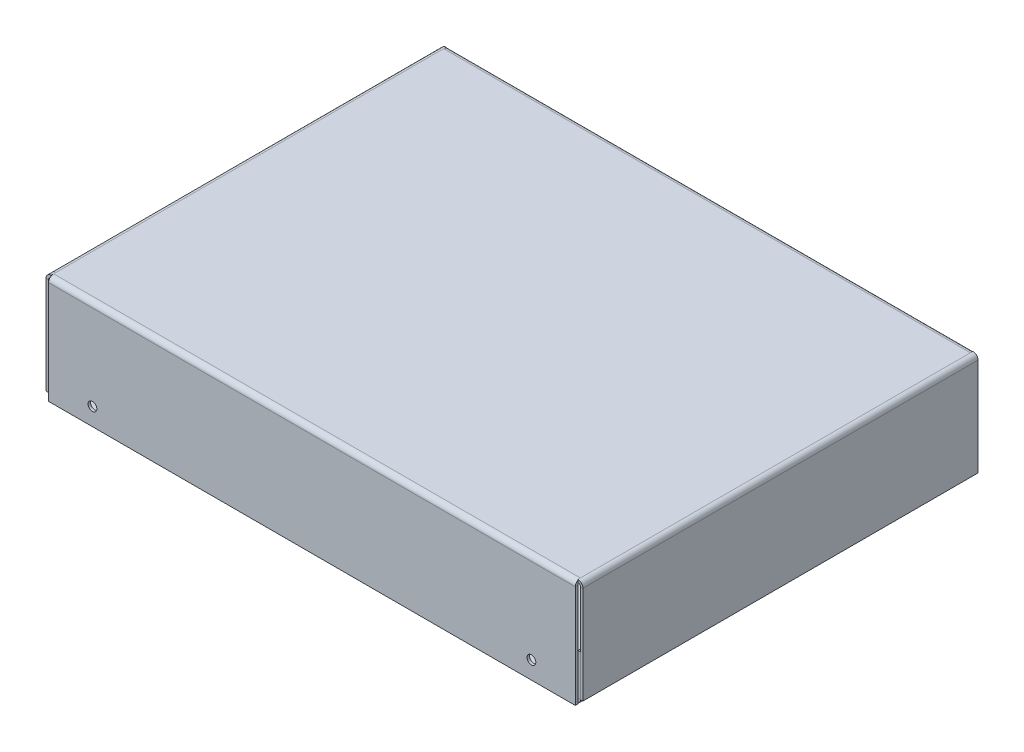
ISO-10303-21;
HEADER;
FILE_DESCRIPTION(('STEP AP214'),'2;1');
FILE_NAME('part.step','',(''),(''),'','','');
FILE_SCHEMA(('AUTOMOTIVE_DESIGN { 1 0 10303 214 1 1 1 1 }'));
ENDSEC;
DATA;
#1=APPLICATION_CONTEXT('core data for automotive mechanical design processes');
#2=APPLICATION_PROTOCOL_DEFINITION('international standard','automotive_design',2000,#1);
#3=PRODUCT_CONTEXT('',#1,'mechanical');
#4=PRODUCT('Part','Part','',(#3));
#5=PRODUCT_RELATED_PRODUCT_CATEGORY('part','',(#4));
#6=PRODUCT_DEFINITION_FORMATION('','',#4);
#7=PRODUCT_DEFINITION_CONTEXT('part definition',#1,'design');
#8=PRODUCT_DEFINITION('design','',#6,#7);
#9=PRODUCT_DEFINITION_SHAPE('','',#8);
#10=(LENGTH_UNIT() NAMED_UNIT(*) SI_UNIT(.MILLI.,.METRE.));
#11=(NAMED_UNIT(*) PLANE_ANGLE_UNIT() SI_UNIT($,.RADIAN.));
#12=(NAMED_UNIT(*) SI_UNIT($,.STERADIAN.) SOLID_ANGLE_UNIT());
#13=UNCERTAINTY_MEASURE_WITH_UNIT(LENGTH_MEASURE(1.E-05),#10,'distance_accuracy_value','');
#14=(GEOMETRIC_REPRESENTATION_CONTEXT(3) GLOBAL_UNCERTAINTY_ASSIGNED_CONTEXT((#13)) GLOBAL_UNIT_ASSIGNED_CONTEXT((#10,
#11,#12)) REPRESENTATION_CONTEXT('',''));
#15=CARTESIAN_POINT('',(0.,0.,0.));
#16=DIRECTION('',(0.,0.,1.));
#17=DIRECTION('',(1.,0.,0.));
#18=AXIS2_PLACEMENT_3D('',#15,#16,#17);
#19=CARTESIAN_POINT('',(152.4,29.7434000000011,0.));
#20=DIRECTION('',(-1.,0.,1.50722647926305E-13));
#21=DIRECTION('',(1.50722647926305E-13,0.,1.));
#22=AXIS2_PLACEMENT_3D('',#19,#20,#21);
#23=PLANE('',#22);
#24=DIRECTION('',(0.,1.,0.));
#25=VECTOR('',#24,1.);
#26=CARTESIAN_POINT('',(152.4,29.7434000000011,0.));
#27=LINE('',#26,#25);
#28=CARTESIAN_POINT('',(152.4,30.2826286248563,0.));
#29=VERTEX_POINT('',#28);
#30=CARTESIAN_POINT('',(152.4,30.4800000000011,0.));
#31=VERTEX_POINT('',#30);
#32=EDGE_CURVE('E62',#29,#31,#27,.T.);
#33=ORIENTED_EDGE('',*,*,#32,.F.);
#34=CARTESIAN_POINT('',(152.4,29.0068000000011,0.736599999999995));
#35=DIRECTION('',(1.,0.,0.));
#36=DIRECTION('',(0.,1.,0.));
#37=AXIS2_PLACEMENT_3D('',#34,#35,#36);
#38=CIRCLE('',#37,1.4732);
#39=CARTESIAN_POINT('',(152.4,30.4800000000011,0.73659999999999));
#40=VERTEX_POINT('',#39);
#41=EDGE_CURVE('E12',#29,#40,#38,.T.);
#42=ORIENTED_EDGE('',*,*,#41,.T.);
#43=DIRECTION('',(0.,0.,1.));
#44=VECTOR('',#43,1.);
#45=CARTESIAN_POINT('',(152.4,30.4800000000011,114.3));
#46=LINE('',#45,#44);
#47=EDGE_CURVE('E347',#31,#40,#46,.T.);
#48=ORIENTED_EDGE('',*,*,#47,.F.);
#49=EDGE_LOOP('',(#33,#42,#48));
#50=FACE_BOUND('',#49,.T.);
#51=ADVANCED_FACE('F45',(#50),#23,.T.);
#52=CARTESIAN_POINT('',(0.,29.7434,0.736599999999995));
#53=DIRECTION('',(1.,0.,0.));
#54=DIRECTION('',(0.,1.,0.));
#55=AXIS2_PLACEMENT_3D('',#52,#53,#54);
#56=PLANE('',#55);
#57=DIRECTION('',(0.,0.,1.));
#58=VECTOR('',#57,1.);
#59=CARTESIAN_POINT('',(0.,30.48,114.3));
#60=LINE('',#59,#58);
#61=CARTESIAN_POINT('',(0.,30.4800000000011,0.));
#62=VERTEX_POINT('',#61);
#63=CARTESIAN_POINT('',(0.,30.48,0.73659999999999));
#64=VERTEX_POINT('',#63);
#65=EDGE_CURVE('E370',#62,#64,#60,.T.);
#66=ORIENTED_EDGE('',*,*,#65,.T.);
#67=CARTESIAN_POINT('',(0.,29.0068,0.736599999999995));
#68=DIRECTION('',(1.,0.,0.));
#69=DIRECTION('',(0.,1.,0.));
#70=AXIS2_PLACEMENT_3D('',#67,#68,#69);
#71=CIRCLE('',#70,1.4732);
#72=CARTESIAN_POINT('',(0.,30.2826286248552,0.));
#73=VERTEX_POINT('',#72);
#74=EDGE_CURVE('E274',#64,#73,#71,.F.);
#75=ORIENTED_EDGE('',*,*,#74,.T.);
#76=DIRECTION('',(0.,1.,0.));
#77=VECTOR('',#76,1.);
#78=CARTESIAN_POINT('',(0.,29.7434,0.));
#79=LINE('',#78,#77);
#80=EDGE_CURVE('E359',#73,#62,#79,.T.);
#81=ORIENTED_EDGE('',*,*,#80,.T.);
#82=EDGE_LOOP('',(#66,#75,#81));
#83=FACE_BOUND('',#82,.T.);
#84=ADVANCED_FACE('F502',(#83),#56,.T.);
#85=CARTESIAN_POINT('',(0.,29.7434,114.3));
#86=DIRECTION('',(1.,0.,0.));
#87=DIRECTION('',(0.,1.,0.));
#88=AXIS2_PLACEMENT_3D('',#85,#86,#87);
#89=PLANE('',#88);
#90=DIRECTION('',(0.,1.,0.));
#91=VECTOR('',#90,1.);
#92=CARTESIAN_POINT('',(0.,29.7434,114.3));
#93=LINE('',#92,#91);
#94=CARTESIAN_POINT('',(0.,30.2826286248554,114.3));
#95=VERTEX_POINT('',#94);
#96=CARTESIAN_POINT('',(0.,30.48,114.3));
#97=VERTEX_POINT('',#96);
#98=EDGE_CURVE('E70',#95,#97,#93,.T.);
#99=ORIENTED_EDGE('',*,*,#98,.F.);
#100=CARTESIAN_POINT('',(0.,29.0068000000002,113.5634));
#101=DIRECTION('',(-1.,0.,0.));
#102=DIRECTION('',(0.,-1.,0.));
#103=AXIS2_PLACEMENT_3D('',#100,#101,#102);
#104=CIRCLE('',#103,1.47320000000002);
#105=CARTESIAN_POINT('',(0.,30.48,113.5634));
#106=VERTEX_POINT('',#105);
#107=EDGE_CURVE('E54',#95,#106,#104,.T.);
#108=ORIENTED_EDGE('',*,*,#107,.T.);
#109=DIRECTION('',(0.,0.,-1.));
#110=VECTOR('',#109,1.);
#111=CARTESIAN_POINT('',(0.,30.48,114.3));
#112=LINE('',#111,#110);
#113=EDGE_CURVE('E343',#97,#106,#112,.T.);
#114=ORIENTED_EDGE('',*,*,#113,.F.);
#115=EDGE_LOOP('',(#99,#108,#114));
#116=FACE_BOUND('',#115,.T.);
#117=ADVANCED_FACE('F525',(#116),#89,.T.);
#118=CARTESIAN_POINT('',(152.4,29.7434000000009,113.5634));
#119=DIRECTION('',(-1.,0.,0.));
#120=DIRECTION('',(0.,-1.,0.));
#121=AXIS2_PLACEMENT_3D('',#118,#119,#120);
#122=PLANE('',#121);
#123=DIRECTION('',(0.,0.,1.));
#124=VECTOR('',#123,1.);
#125=CARTESIAN_POINT('',(152.4,30.4800000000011,114.3));
#126=LINE('',#125,#124);
#127=CARTESIAN_POINT('',(152.4,30.4800000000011,113.5634));
#128=VERTEX_POINT('',#127);
#129=CARTESIAN_POINT('',(152.4,30.4800000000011,114.3));
#130=VERTEX_POINT('',#129);
#131=EDGE_CURVE('E338',#128,#130,#126,.T.);
#132=ORIENTED_EDGE('',*,*,#131,.F.);
#133=CARTESIAN_POINT('',(152.4,29.0068000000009,113.5634));
#134=DIRECTION('',(-1.,0.,0.));
#135=DIRECTION('',(0.,-1.,0.));
#136=AXIS2_PLACEMENT_3D('',#133,#134,#135);
#137=CIRCLE('',#136,1.47320000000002);
#138=CARTESIAN_POINT('',(152.4,30.2826286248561,114.3));
#139=VERTEX_POINT('',#138);
#140=EDGE_CURVE('E321',#128,#139,#137,.F.);
#141=ORIENTED_EDGE('',*,*,#140,.T.);
#142=DIRECTION('',(0.,1.,0.));
#143=VECTOR('',#142,1.);
#144=CARTESIAN_POINT('',(152.4,29.7434000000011,114.3));
#145=LINE('',#144,#143);
#146=EDGE_CURVE('E355',#139,#130,#145,.T.);
#147=ORIENTED_EDGE('',*,*,#146,.T.);
#148=EDGE_LOOP('',(#132,#141,#147));
#149=FACE_BOUND('',#148,.T.);
#150=ADVANCED_FACE('F529',(#149),#122,.T.);
#151=CARTESIAN_POINT('',(-0.736600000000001,30.48,114.3));
#152=DIRECTION('',(0.,1.,0.));
#153=DIRECTION('',(-1.,0.,0.));
#154=AXIS2_PLACEMENT_3D('',#151,#152,#153);
#155=PLANE('',#154);
#156=EDGE_CURVE('E346',#40,#128,#46,.T.);
#157=ORIENTED_EDGE('',*,*,#156,.F.);
#158=DIRECTION('',(1.,0.,0.));
#159=VECTOR('',#158,1.);
#160=CARTESIAN_POINT('',(152.4,30.4800000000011,0.736599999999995));
#161=LINE('',#160,#159);
#162=EDGE_CURVE('E230',#40,#64,#161,.F.);
#163=ORIENTED_EDGE('',*,*,#162,.T.);
#164=EDGE_CURVE('E366',#64,#106,#60,.T.);
#165=ORIENTED_EDGE('',*,*,#164,.T.);
#166=DIRECTION('',(-1.,0.,0.));
#167=VECTOR('',#166,1.);
#168=CARTESIAN_POINT('',(0.,30.4800000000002,113.5634));
#169=LINE('',#168,#167);
#170=EDGE_CURVE('E316',#106,#128,#169,.F.);
#171=ORIENTED_EDGE('',*,*,#170,.T.);
#172=EDGE_LOOP('',(#157,#163,#165,#171));
#173=FACE_BOUND('',#172,.T.);
#174=ADVANCED_FACE('F514',(#173),#155,.T.);
#175=CARTESIAN_POINT('',(-0.736599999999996,29.7434,114.3));
#176=DIRECTION('',(0.,1.,0.));
#177=DIRECTION('',(-1.,0.,0.));
#178=AXIS2_PLACEMENT_3D('',#175,#176,#177);
#179=PLANE('',#178);
#180=DIRECTION('',(1.,0.,0.));
#181=VECTOR('',#180,1.);
#182=CARTESIAN_POINT('',(152.4,29.7434000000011,0.736599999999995));
#183=LINE('',#182,#181);
#184=CARTESIAN_POINT('',(152.4,29.7434000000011,0.736599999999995));
#185=VERTEX_POINT('',#184);
#186=CARTESIAN_POINT('',(0.,29.7434,0.73659999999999));
#187=VERTEX_POINT('',#186);
#188=EDGE_CURVE('E280',#185,#187,#183,.F.);
#189=ORIENTED_EDGE('',*,*,#188,.F.);
#190=DIRECTION('',(0.,0.,1.));
#191=VECTOR('',#190,1.);
#192=CARTESIAN_POINT('',(152.4,29.7434000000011,0.));
#193=LINE('',#192,#191);
#194=CARTESIAN_POINT('',(152.4,29.7434000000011,113.5634));
#195=VERTEX_POINT('',#194);
#196=EDGE_CURVE('E352',#185,#195,#193,.T.);
#197=ORIENTED_EDGE('',*,*,#196,.T.);
#198=DIRECTION('',(-1.,0.,0.));
#199=VECTOR('',#198,1.);
#200=CARTESIAN_POINT('',(0.,29.7434000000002,113.5634));
#201=LINE('',#200,#199);
#202=CARTESIAN_POINT('',(0.,29.7434,113.5634));
#203=VERTEX_POINT('',#202);
#204=EDGE_CURVE('E330',#203,#195,#201,.F.);
#205=ORIENTED_EDGE('',*,*,#204,.F.);
#206=DIRECTION('',(0.,0.,1.));
#207=VECTOR('',#206,1.);
#208=CARTESIAN_POINT('',(0.,29.7434,0.));
#209=LINE('',#208,#207);
#210=EDGE_CURVE('E363',#187,#203,#209,.T.);
#211=ORIENTED_EDGE('',*,*,#210,.F.);
#212=EDGE_LOOP('',(#189,#197,#205,#211));
#213=FACE_BOUND('',#212,.T.);
#214=ADVANCED_FACE('F537',(#213),#179,.F.);
#215=CARTESIAN_POINT('',(153.8732,29.7434,0.));
#216=DIRECTION('',(0.,0.,1.));
#217=DIRECTION('',(0.,-1.,0.));
#218=AXIS2_PLACEMENT_3D('',#215,#216,#217);
#219=PLANE('',#218);
#220=DIRECTION('',(1.,0.,0.));
#221=VECTOR('',#220,1.);
#222=CARTESIAN_POINT('',(153.1366,29.0068000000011,0.));
#223=LINE('',#222,#221);
#224=CARTESIAN_POINT('',(153.1366,29.0068000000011,0.));
#225=VERTEX_POINT('',#224);
#226=CARTESIAN_POINT('',(153.8732,29.0068000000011,0.));
#227=VERTEX_POINT('',#226);
#228=EDGE_CURVE('E422',#225,#227,#223,.T.);
#229=ORIENTED_EDGE('',*,*,#228,.T.);
#230=DIRECTION('',(0.,1.,0.));
#231=VECTOR('',#230,1.);
#232=CARTESIAN_POINT('',(153.8732,29.7434,0.));
#233=LINE('',#232,#231);
#234=CARTESIAN_POINT('',(153.8732,0.7366,0.));
#235=VERTEX_POINT('',#234);
#236=EDGE_CURVE('E441',#235,#227,#233,.T.);
#237=ORIENTED_EDGE('',*,*,#236,.F.);
#238=DIRECTION('',(-1.,0.,0.));
#239=VECTOR('',#238,1.);
#240=CARTESIAN_POINT('',(153.8732,0.7366,0.));
#241=LINE('',#240,#239);
#242=CARTESIAN_POINT('',(153.1366,0.7366,0.));
#243=VERTEX_POINT('',#242);
#244=EDGE_CURVE('E455',#235,#243,#241,.T.);
#245=ORIENTED_EDGE('',*,*,#244,.T.);
#246=DIRECTION('',(0.,1.,0.));
#247=VECTOR('',#246,1.);
#248=CARTESIAN_POINT('',(153.1366,29.7434,0.));
#249=LINE('',#248,#247);
#250=EDGE_CURVE('E449',#243,#225,#249,.T.);
#251=ORIENTED_EDGE('',*,*,#250,.T.);
#252=EDGE_LOOP('',(#229,#237,#245,#251));
#253=FACE_BOUND('',#252,.T.);
#254=ADVANCED_FACE('F540',(#253),#219,.F.);
#255=CARTESIAN_POINT('',(153.8732,0.7366,114.3));
#256=DIRECTION('',(0.,0.,-1.));
#257=DIRECTION('',(-1.,0.,0.));
#258=AXIS2_PLACEMENT_3D('',#255,#256,#257);
#259=PLANE('',#258);
#260=DIRECTION('',(1.,0.,0.));
#261=VECTOR('',#260,1.);
#262=CARTESIAN_POINT('',(153.1366,29.0068000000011,114.3));
#263=LINE('',#262,#261);
#264=CARTESIAN_POINT('',(153.1366,29.0068000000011,114.3));
#265=VERTEX_POINT('',#264);
#266=CARTESIAN_POINT('',(153.8732,29.0068000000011,114.3));
#267=VERTEX_POINT('',#266);
#268=EDGE_CURVE('E432',#265,#267,#263,.T.);
#269=ORIENTED_EDGE('',*,*,#268,.F.);
#270=DIRECTION('',(0.,-1.,0.));
#271=VECTOR('',#270,1.);
#272=CARTESIAN_POINT('',(153.1366,0.7366,114.3));
#273=LINE('',#272,#271);
#274=CARTESIAN_POINT('',(153.1366,0.7366,114.3));
#275=VERTEX_POINT('',#274);
#276=EDGE_CURVE('E442',#265,#275,#273,.T.);
#277=ORIENTED_EDGE('',*,*,#276,.T.);
#278=DIRECTION('',(-1.,0.,0.));
#279=VECTOR('',#278,1.);
#280=CARTESIAN_POINT('',(153.8732,0.7366,114.3));
#281=LINE('',#280,#279);
#282=CARTESIAN_POINT('',(153.8732,0.7366,114.3));
#283=VERTEX_POINT('',#282);
#284=EDGE_CURVE('E446',#283,#275,#281,.T.);
#285=ORIENTED_EDGE('',*,*,#284,.F.);
#286=DIRECTION('',(0.,-1.,0.));
#287=VECTOR('',#286,1.);
#288=CARTESIAN_POINT('',(153.8732,0.7366,114.3));
#289=LINE('',#288,#287);
#290=EDGE_CURVE('E444',#267,#283,#289,.T.);
#291=ORIENTED_EDGE('',*,*,#290,.F.);
#292=EDGE_LOOP('',(#269,#277,#285,#291));
#293=FACE_BOUND('',#292,.T.);
#294=ADVANCED_FACE('F595',(#293),#259,.F.);
#295=CARTESIAN_POINT('',(153.8732,0.7366,114.3));
#296=DIRECTION('',(-1.,0.,0.));
#297=DIRECTION('',(0.,0.,1.));
#298=AXIS2_PLACEMENT_3D('',#295,#296,#297);
#299=PLANE('',#298);
#300=DIRECTION('',(0.,0.,-1.));
#301=VECTOR('',#300,1.);
#302=CARTESIAN_POINT('',(153.8732,29.0068000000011,0.));
#303=LINE('',#302,#301);
#304=EDGE_CURVE('E416',#227,#267,#303,.F.);
#305=ORIENTED_EDGE('',*,*,#304,.T.);
#306=ORIENTED_EDGE('',*,*,#290,.T.);
#307=DIRECTION('',(0.,0.,-1.));
#308=VECTOR('',#307,1.);
#309=CARTESIAN_POINT('',(153.8732,0.7366,0.));
#310=LINE('',#309,#308);
#311=EDGE_CURVE('E438',#283,#235,#310,.T.);
#312=ORIENTED_EDGE('',*,*,#311,.T.);
#313=ORIENTED_EDGE('',*,*,#236,.T.);
#314=EDGE_LOOP('',(#305,#306,#312,#313));
#315=FACE_BOUND('',#314,.T.);
#316=ADVANCED_FACE('F591',(#315),#299,.F.);
#317=CARTESIAN_POINT('',(153.1366,0.7366,114.3));
#318=DIRECTION('',(-1.,0.,0.));
#319=DIRECTION('',(0.,0.,1.));
#320=AXIS2_PLACEMENT_3D('',#317,#318,#319);
#321=PLANE('',#320);
#322=ORIENTED_EDGE('',*,*,#276,.F.);
#323=DIRECTION('',(0.,0.,-1.));
#324=VECTOR('',#323,1.);
#325=CARTESIAN_POINT('',(153.1366,29.0068000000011,0.));
#326=LINE('',#325,#324);
#327=EDGE_CURVE('E427',#225,#265,#326,.F.);
#328=ORIENTED_EDGE('',*,*,#327,.F.);
#329=ORIENTED_EDGE('',*,*,#250,.F.);
#330=DIRECTION('',(0.,0.,-1.));
#331=VECTOR('',#330,1.);
#332=CARTESIAN_POINT('',(153.1366,0.7366,0.));
#333=LINE('',#332,#331);
#334=EDGE_CURVE('E435',#275,#243,#333,.T.);
#335=ORIENTED_EDGE('',*,*,#334,.F.);
#336=EDGE_LOOP('',(#322,#328,#329,#335));
#337=FACE_BOUND('',#336,.T.);
#338=ADVANCED_FACE('F594',(#337),#321,.T.);
#339=CARTESIAN_POINT('',(153.8732,0.7366,0.));
#340=DIRECTION('',(0.,1.,0.));
#341=DIRECTION('',(0.,0.,1.));
#342=AXIS2_PLACEMENT_3D('',#339,#340,#341);
#343=PLANE('',#342);
#344=ORIENTED_EDGE('',*,*,#334,.T.);
#345=ORIENTED_EDGE('',*,*,#244,.F.);
#346=ORIENTED_EDGE('',*,*,#311,.F.);
#347=ORIENTED_EDGE('',*,*,#284,.T.);
#348=EDGE_LOOP('',(#344,#345,#346,#347));
#349=FACE_BOUND('',#348,.T.);
#350=ADVANCED_FACE('F47',(#349),#343,.F.);
#351=CARTESIAN_POINT('',(152.4,29.0068000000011,114.3));
#352=DIRECTION('',(0.,0.,1.));
#353=DIRECTION('',(1.,0.,0.));
#354=AXIS2_PLACEMENT_3D('',#351,#352,#353);
#355=PLANE('',#354);
#356=CARTESIAN_POINT('',(152.4,29.7434000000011,114.3));
#357=VERTEX_POINT('',#356);
#358=EDGE_CURVE('E356',#357,#139,#145,.T.);
#359=ORIENTED_EDGE('',*,*,#358,.F.);
#360=CARTESIAN_POINT('',(152.4,29.0068000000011,114.3));
#361=DIRECTION('',(0.,0.,-1.));
#362=DIRECTION('',(-1.,0.,0.));
#363=AXIS2_PLACEMENT_3D('',#360,#361,#362);
#364=CIRCLE('',#363,0.7366);
#365=EDGE_CURVE('E425',#265,#357,#364,.F.);
#366=ORIENTED_EDGE('',*,*,#365,.F.);
#367=ORIENTED_EDGE('',*,*,#268,.T.);
#368=CARTESIAN_POINT('',(152.4,29.0068000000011,114.3));
#369=DIRECTION('',(0.,0.,-1.));
#370=DIRECTION('',(-1.,0.,0.));
#371=AXIS2_PLACEMENT_3D('',#368,#369,#370);
#372=CIRCLE('',#371,1.4732);
#373=EDGE_CURVE('E418',#267,#130,#372,.F.);
#374=ORIENTED_EDGE('',*,*,#373,.T.);
#375=ORIENTED_EDGE('',*,*,#146,.F.);
#376=EDGE_LOOP('',(#359,#366,#367,#374,#375));
#377=FACE_BOUND('',#376,.T.);
#378=ADVANCED_FACE('F581',(#377),#355,.T.);
#379=CARTESIAN_POINT('',(152.4,29.0068000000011,0.));
#380=DIRECTION('',(0.,0.,1.));
#381=DIRECTION('',(1.,0.,0.));
#382=AXIS2_PLACEMENT_3D('',#379,#380,#381);
#383=PLANE('',#382);
#384=CARTESIAN_POINT('',(152.4,29.0068000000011,0.));
#385=DIRECTION('',(0.,0.,-1.));
#386=DIRECTION('',(-1.,0.,0.));
#387=AXIS2_PLACEMENT_3D('',#384,#385,#386);
#388=CIRCLE('',#387,0.7366);
#389=CARTESIAN_POINT('',(152.4,29.7434000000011,0.));
#390=VERTEX_POINT('',#389);
#391=EDGE_CURVE('E415',#390,#225,#388,.T.);
#392=ORIENTED_EDGE('',*,*,#391,.F.);
#393=EDGE_CURVE('E350',#390,#29,#27,.T.);
#394=ORIENTED_EDGE('',*,*,#393,.T.);
#395=ORIENTED_EDGE('',*,*,#32,.T.);
#396=CARTESIAN_POINT('',(152.4,29.0068000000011,0.));
#397=DIRECTION('',(0.,0.,-1.));
#398=DIRECTION('',(-1.,0.,0.));
#399=AXIS2_PLACEMENT_3D('',#396,#397,#398);
#400=CIRCLE('',#399,1.4732);
#401=EDGE_CURVE('E419',#31,#227,#400,.T.);
#402=ORIENTED_EDGE('',*,*,#401,.T.);
#403=ORIENTED_EDGE('',*,*,#228,.F.);
#404=EDGE_LOOP('',(#392,#394,#395,#402,#403));
#405=FACE_BOUND('',#404,.T.);
#406=ADVANCED_FACE('F580',(#405),#383,.F.);
#407=CARTESIAN_POINT('',(152.4,29.0068000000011,0.));
#408=DIRECTION('',(0.,0.,-1.));
#409=DIRECTION('',(0.,1.,0.));
#410=AXIS2_PLACEMENT_3D('',#407,#408,#409);
#411=CYLINDRICAL_SURFACE('',#410,1.4732);
#412=ORIENTED_EDGE('',*,*,#304,.F.);
#413=ORIENTED_EDGE('',*,*,#401,.F.);
#414=ORIENTED_EDGE('',*,*,#47,.T.);
#415=ORIENTED_EDGE('',*,*,#156,.T.);
#416=ORIENTED_EDGE('',*,*,#131,.T.);
#417=ORIENTED_EDGE('',*,*,#373,.F.);
#418=EDGE_LOOP('',(#412,#413,#414,#415,#416,#417));
#419=FACE_BOUND('',#418,.T.);
#420=ADVANCED_FACE('F519',(#419),#411,.T.);
#421=CARTESIAN_POINT('',(152.4,29.0068000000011,0.));
#422=DIRECTION('',(0.,0.,-1.));
#423=DIRECTION('',(0.,1.,0.));
#424=AXIS2_PLACEMENT_3D('',#421,#422,#423);
#425=CYLINDRICAL_SURFACE('',#424,0.7366);
#426=ORIENTED_EDGE('',*,*,#327,.T.);
#427=ORIENTED_EDGE('',*,*,#365,.T.);
#428=DIRECTION('',(0.,2.1195372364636E-13,1.));
#429=VECTOR('',#428,1.);
#430=CARTESIAN_POINT('',(152.4,29.7434000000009,113.5634));
#431=LINE('',#430,#429);
#432=EDGE_CURVE('E324',#195,#357,#431,.T.);
#433=ORIENTED_EDGE('',*,*,#432,.F.);
#434=ORIENTED_EDGE('',*,*,#196,.F.);
#435=EDGE_CURVE('E353',#390,#185,#193,.T.);
#436=ORIENTED_EDGE('',*,*,#435,.F.);
#437=ORIENTED_EDGE('',*,*,#391,.T.);
#438=EDGE_LOOP('',(#426,#427,#433,#434,#436,#437));
#439=FACE_BOUND('',#438,.T.);
#440=ADVANCED_FACE('F576',(#439),#425,.F.);
#441=CARTESIAN_POINT('',(-1.4732,0.736600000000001,0.));
#442=DIRECTION('',(0.,0.,1.));
#443=DIRECTION('',(1.,0.,0.));
#444=AXIS2_PLACEMENT_3D('',#441,#442,#443);
#445=PLANE('',#444);
#446=DIRECTION('',(-1.,0.,0.));
#447=VECTOR('',#446,1.);
#448=CARTESIAN_POINT('',(-0.736599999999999,29.0068,0.));
#449=LINE('',#448,#447);
#450=CARTESIAN_POINT('',(-0.736599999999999,29.0068,0.));
#451=VERTEX_POINT('',#450);
#452=CARTESIAN_POINT('',(-1.4732,29.0068,0.));
#453=VERTEX_POINT('',#452);
#454=EDGE_CURVE('E391',#451,#453,#449,.T.);
#455=ORIENTED_EDGE('',*,*,#454,.F.);
#456=DIRECTION('',(0.,-1.,0.));
#457=VECTOR('',#456,1.);
#458=CARTESIAN_POINT('',(-0.7366,0.7366,0.));
#459=LINE('',#458,#457);
#460=CARTESIAN_POINT('',(-0.7366,0.7366,0.));
#461=VERTEX_POINT('',#460);
#462=EDGE_CURVE('E394',#451,#461,#459,.T.);
#463=ORIENTED_EDGE('',*,*,#462,.T.);
#464=DIRECTION('',(1.,0.,0.));
#465=VECTOR('',#464,1.);
#466=CARTESIAN_POINT('',(-1.4732,0.736600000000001,0.));
#467=LINE('',#466,#465);
#468=CARTESIAN_POINT('',(-1.4732,0.736600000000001,0.));
#469=VERTEX_POINT('',#468);
#470=EDGE_CURVE('E412',#469,#461,#467,.T.);
#471=ORIENTED_EDGE('',*,*,#470,.F.);
#472=DIRECTION('',(0.,-1.,0.));
#473=VECTOR('',#472,1.);
#474=CARTESIAN_POINT('',(-1.4732,0.736600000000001,0.));
#475=LINE('',#474,#473);
#476=EDGE_CURVE('E397',#453,#469,#475,.T.);
#477=ORIENTED_EDGE('',*,*,#476,.F.);
#478=EDGE_LOOP('',(#455,#463,#471,#477));
#479=FACE_BOUND('',#478,.T.);
#480=ADVANCED_FACE('F569',(#479),#445,.F.);
#481=CARTESIAN_POINT('',(-1.4732,0.736600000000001,114.3));
#482=DIRECTION('',(0.,0.,-1.));
#483=DIRECTION('',(-1.,0.,0.));
#484=AXIS2_PLACEMENT_3D('',#481,#482,#483);
#485=PLANE('',#484);
#486=DIRECTION('',(-1.,0.,0.));
#487=VECTOR('',#486,1.);
#488=CARTESIAN_POINT('',(-0.736599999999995,29.0068,114.3));
#489=LINE('',#488,#487);
#490=CARTESIAN_POINT('',(-0.736599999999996,29.0068,114.3));
#491=VERTEX_POINT('',#490);
#492=CARTESIAN_POINT('',(-1.4732,29.0068,114.3));
#493=VERTEX_POINT('',#492);
#494=EDGE_CURVE('E380',#491,#493,#489,.T.);
#495=ORIENTED_EDGE('',*,*,#494,.T.);
#496=DIRECTION('',(0.,1.,0.));
#497=VECTOR('',#496,1.);
#498=CARTESIAN_POINT('',(-1.4732,0.736600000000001,114.3));
#499=LINE('',#498,#497);
#500=CARTESIAN_POINT('',(-1.4732,0.736600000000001,114.3));
#501=VERTEX_POINT('',#500);
#502=EDGE_CURVE('E402',#501,#493,#499,.T.);
#503=ORIENTED_EDGE('',*,*,#502,.F.);
#504=DIRECTION('',(1.,0.,0.));
#505=VECTOR('',#504,1.);
#506=CARTESIAN_POINT('',(-1.4732,0.736600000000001,114.3));
#507=LINE('',#506,#505);
#508=CARTESIAN_POINT('',(-0.7366,0.7366,114.3));
#509=VERTEX_POINT('',#508);
#510=EDGE_CURVE('E404',#501,#509,#507,.T.);
#511=ORIENTED_EDGE('',*,*,#510,.T.);
#512=DIRECTION('',(0.,1.,0.));
#513=VECTOR('',#512,1.);
#514=CARTESIAN_POINT('',(-0.7366,0.7366,114.3));
#515=LINE('',#514,#513);
#516=EDGE_CURVE('E400',#509,#491,#515,.T.);
#517=ORIENTED_EDGE('',*,*,#516,.T.);
#518=EDGE_LOOP('',(#495,#503,#511,#517));
#519=FACE_BOUND('',#518,.T.);
#520=ADVANCED_FACE('F562',(#519),#485,.F.);
#521=CARTESIAN_POINT('',(-1.4732,29.7434,0.));
#522=DIRECTION('',(1.,0.,0.));
#523=DIRECTION('',(0.,1.,0.));
#524=AXIS2_PLACEMENT_3D('',#521,#522,#523);
#525=PLANE('',#524);
#526=DIRECTION('',(0.,0.,1.));
#527=VECTOR('',#526,1.);
#528=CARTESIAN_POINT('',(-1.4732,29.0068,114.3));
#529=LINE('',#528,#527);
#530=EDGE_CURVE('E374',#493,#453,#529,.F.);
#531=ORIENTED_EDGE('',*,*,#530,.T.);
#532=ORIENTED_EDGE('',*,*,#476,.T.);
#533=DIRECTION('',(0.,0.,1.));
#534=VECTOR('',#533,1.);
#535=CARTESIAN_POINT('',(-1.4732,0.736600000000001,0.));
#536=LINE('',#535,#534);
#537=EDGE_CURVE('E399',#469,#501,#536,.T.);
#538=ORIENTED_EDGE('',*,*,#537,.T.);
#539=ORIENTED_EDGE('',*,*,#502,.T.);
#540=EDGE_LOOP('',(#531,#532,#538,#539));
#541=FACE_BOUND('',#540,.T.);
#542=ADVANCED_FACE('F558',(#541),#525,.F.);
#543=CARTESIAN_POINT('',(-0.736599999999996,29.7434,0.));
#544=DIRECTION('',(1.,0.,0.));
#545=DIRECTION('',(0.,1.,0.));
#546=AXIS2_PLACEMENT_3D('',#543,#544,#545);
#547=PLANE('',#546);
#548=ORIENTED_EDGE('',*,*,#462,.F.);
#549=DIRECTION('',(0.,0.,1.));
#550=VECTOR('',#549,1.);
#551=CARTESIAN_POINT('',(-0.736599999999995,29.0068,114.3));
#552=LINE('',#551,#550);
#553=EDGE_CURVE('E386',#491,#451,#552,.F.);
#554=ORIENTED_EDGE('',*,*,#553,.F.);
#555=ORIENTED_EDGE('',*,*,#516,.F.);
#556=DIRECTION('',(0.,0.,1.));
#557=VECTOR('',#556,1.);
#558=CARTESIAN_POINT('',(-0.7366,0.7366,0.));
#559=LINE('',#558,#557);
#560=EDGE_CURVE('E406',#461,#509,#559,.T.);
#561=ORIENTED_EDGE('',*,*,#560,.F.);
#562=EDGE_LOOP('',(#548,#554,#555,#561));
#563=FACE_BOUND('',#562,.T.);
#564=ADVANCED_FACE('F561',(#563),#547,.T.);
#565=CARTESIAN_POINT('',(-1.4732,0.736600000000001,0.));
#566=DIRECTION('',(0.,1.,0.));
#567=DIRECTION('',(-1.,0.,0.));
#568=AXIS2_PLACEMENT_3D('',#565,#566,#567);
#569=PLANE('',#568);
#570=ORIENTED_EDGE('',*,*,#560,.T.);
#571=ORIENTED_EDGE('',*,*,#510,.F.);
#572=ORIENTED_EDGE('',*,*,#537,.F.);
#573=ORIENTED_EDGE('',*,*,#470,.T.);
#574=EDGE_LOOP('',(#570,#571,#572,#573));
#575=FACE_BOUND('',#574,.T.);
#576=ADVANCED_FACE('F553',(#575),#569,.F.);
#577=CARTESIAN_POINT('',(0.,29.0068,0.));
#578=DIRECTION('',(0.,0.,-1.));
#579=DIRECTION('',(-1.,0.,0.));
#580=AXIS2_PLACEMENT_3D('',#577,#578,#579);
#581=PLANE('',#580);
#582=CARTESIAN_POINT('',(0.,29.7434,0.));
#583=VERTEX_POINT('',#582);
#584=EDGE_CURVE('E367',#583,#73,#79,.T.);
#585=ORIENTED_EDGE('',*,*,#584,.F.);
#586=CARTESIAN_POINT('',(0.,29.0068,0.));
#587=DIRECTION('',(0.,0.,1.));
#588=DIRECTION('',(1.,0.,0.));
#589=AXIS2_PLACEMENT_3D('',#586,#587,#588);
#590=CIRCLE('',#589,0.7366);
#591=EDGE_CURVE('E383',#451,#583,#590,.F.);
#592=ORIENTED_EDGE('',*,*,#591,.F.);
#593=ORIENTED_EDGE('',*,*,#454,.T.);
#594=CARTESIAN_POINT('',(0.,29.0068,0.));
#595=DIRECTION('',(0.,0.,1.));
#596=DIRECTION('',(1.,0.,0.));
#597=AXIS2_PLACEMENT_3D('',#594,#595,#596);
#598=CIRCLE('',#597,1.4732);
#599=EDGE_CURVE('E376',#453,#62,#598,.F.);
#600=ORIENTED_EDGE('',*,*,#599,.T.);
#601=ORIENTED_EDGE('',*,*,#80,.F.);
#602=EDGE_LOOP('',(#585,#592,#593,#600,#601));
#603=FACE_BOUND('',#602,.T.);
#604=ADVANCED_FACE('F546',(#603),#581,.T.);
#605=CARTESIAN_POINT('',(0.,29.0068,114.3));
#606=DIRECTION('',(0.,0.,-1.));
#607=DIRECTION('',(-1.,0.,0.));
#608=AXIS2_PLACEMENT_3D('',#605,#606,#607);
#609=PLANE('',#608);
#610=CARTESIAN_POINT('',(0.,29.0068,114.3));
#611=DIRECTION('',(0.,0.,1.));
#612=DIRECTION('',(1.,0.,0.));
#613=AXIS2_PLACEMENT_3D('',#610,#611,#612);
#614=CIRCLE('',#613,0.7366);
#615=CARTESIAN_POINT('',(0.,29.7434,114.3));
#616=VERTEX_POINT('',#615);
#617=EDGE_CURVE('E373',#616,#491,#614,.T.);
#618=ORIENTED_EDGE('',*,*,#617,.F.);
#619=EDGE_CURVE('E364',#616,#95,#93,.T.);
#620=ORIENTED_EDGE('',*,*,#619,.T.);
#621=ORIENTED_EDGE('',*,*,#98,.T.);
#622=CARTESIAN_POINT('',(0.,29.0068,114.3));
#623=DIRECTION('',(0.,0.,1.));
#624=DIRECTION('',(1.,0.,0.));
#625=AXIS2_PLACEMENT_3D('',#622,#623,#624);
#626=CIRCLE('',#625,1.4732);
#627=EDGE_CURVE('E377',#97,#493,#626,.T.);
#628=ORIENTED_EDGE('',*,*,#627,.T.);
#629=ORIENTED_EDGE('',*,*,#494,.F.);
#630=EDGE_LOOP('',(#618,#620,#621,#628,#629));
#631=FACE_BOUND('',#630,.T.);
#632=ADVANCED_FACE('F545',(#631),#609,.F.);
#633=CARTESIAN_POINT('',(0.,29.0068,114.3));
#634=DIRECTION('',(0.,0.,1.));
#635=DIRECTION('',(0.,1.,0.));
#636=AXIS2_PLACEMENT_3D('',#633,#634,#635);
#637=CYLINDRICAL_SURFACE('',#636,1.4732);
#638=ORIENTED_EDGE('',*,*,#530,.F.);
#639=ORIENTED_EDGE('',*,*,#627,.F.);
#640=ORIENTED_EDGE('',*,*,#113,.T.);
#641=ORIENTED_EDGE('',*,*,#164,.F.);
#642=ORIENTED_EDGE('',*,*,#65,.F.);
#643=ORIENTED_EDGE('',*,*,#599,.F.);
#644=EDGE_LOOP('',(#638,#639,#640,#641,#642,#643));
#645=FACE_BOUND('',#644,.T.);
#646=ADVANCED_FACE('F508',(#645),#637,.T.);
#647=CARTESIAN_POINT('',(0.,29.0068,114.3));
#648=DIRECTION('',(0.,0.,1.));
#649=DIRECTION('',(0.,1.,0.));
#650=AXIS2_PLACEMENT_3D('',#647,#648,#649);
#651=CYLINDRICAL_SURFACE('',#650,0.7366);
#652=ORIENTED_EDGE('',*,*,#553,.T.);
#653=ORIENTED_EDGE('',*,*,#591,.T.);
#654=EDGE_CURVE('E360',#583,#187,#209,.T.);
#655=ORIENTED_EDGE('',*,*,#654,.T.);
#656=ORIENTED_EDGE('',*,*,#210,.T.);
#657=DIRECTION('',(0.,2.49634385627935E-13,-1.));
#658=VECTOR('',#657,1.);
#659=CARTESIAN_POINT('',(0.,29.7434,114.3));
#660=LINE('',#659,#658);
#661=EDGE_CURVE('E335',#616,#203,#660,.T.);
#662=ORIENTED_EDGE('',*,*,#661,.F.);
#663=ORIENTED_EDGE('',*,*,#617,.T.);
#664=EDGE_LOOP('',(#652,#653,#655,#656,#662,#663));
#665=FACE_BOUND('',#664,.T.);
#666=ADVANCED_FACE('F544',(#665),#651,.F.);
#667=CARTESIAN_POINT('',(0.,29.0068000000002,113.5634));
#668=DIRECTION('',(1.,0.,0.));
#669=DIRECTION('',(0.,1.,0.));
#670=AXIS2_PLACEMENT_3D('',#667,#668,#669);
#671=PLANE('',#670);
#672=ORIENTED_EDGE('',*,*,#619,.F.);
#673=ORIENTED_EDGE('',*,*,#661,.T.);
#674=CARTESIAN_POINT('',(0.,29.0068000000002,113.5634));
#675=DIRECTION('',(-1.,0.,0.));
#676=DIRECTION('',(0.,-1.,0.));
#677=AXIS2_PLACEMENT_3D('',#674,#675,#676);
#678=CIRCLE('',#677,0.736600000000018);
#679=CARTESIAN_POINT('',(0.,29.0068000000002,114.3));
#680=VERTEX_POINT('',#679);
#681=EDGE_CURVE('E313',#680,#203,#678,.T.);
#682=ORIENTED_EDGE('',*,*,#681,.F.);
#683=DIRECTION('',(0.,0.,1.));
#684=VECTOR('',#683,1.);
#685=CARTESIAN_POINT('',(0.,29.0068,114.3));
#686=LINE('',#685,#684);
#687=CARTESIAN_POINT('',(0.,29.0068000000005,115.0366));
#688=VERTEX_POINT('',#687);
#689=EDGE_CURVE('E286',#680,#688,#686,.T.);
#690=ORIENTED_EDGE('',*,*,#689,.T.);
#691=EDGE_CURVE('E320',#688,#95,#104,.T.);
#692=ORIENTED_EDGE('',*,*,#691,.T.);
#693=EDGE_LOOP('',(#672,#673,#682,#690,#692));
#694=FACE_BOUND('',#693,.T.);
#695=ADVANCED_FACE('F549',(#694),#671,.F.);
#696=CARTESIAN_POINT('',(152.4,29.0068000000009,113.5634));
#697=DIRECTION('',(1.,0.,0.));
#698=DIRECTION('',(0.,1.,0.));
#699=AXIS2_PLACEMENT_3D('',#696,#697,#698);
#700=PLANE('',#699);
#701=CARTESIAN_POINT('',(152.4,29.0068000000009,113.5634));
#702=DIRECTION('',(-1.,0.,0.));
#703=DIRECTION('',(0.,-1.,0.));
#704=AXIS2_PLACEMENT_3D('',#701,#702,#703);
#705=CIRCLE('',#704,0.736600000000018);
#706=CARTESIAN_POINT('',(152.4,29.0068000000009,114.3));
#707=VERTEX_POINT('',#706);
#708=EDGE_CURVE('E327',#195,#707,#705,.F.);
#709=ORIENTED_EDGE('',*,*,#708,.F.);
#710=ORIENTED_EDGE('',*,*,#432,.T.);
#711=ORIENTED_EDGE('',*,*,#358,.T.);
#712=CARTESIAN_POINT('',(152.4,29.0068000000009,115.0366));
#713=VERTEX_POINT('',#712);
#714=EDGE_CURVE('E319',#139,#713,#137,.F.);
#715=ORIENTED_EDGE('',*,*,#714,.T.);
#716=DIRECTION('',(0.,0.,1.));
#717=VECTOR('',#716,1.);
#718=CARTESIAN_POINT('',(152.4,29.0068000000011,114.3));
#719=LINE('',#718,#717);
#720=EDGE_CURVE('E276',#707,#713,#719,.T.);
#721=ORIENTED_EDGE('',*,*,#720,.F.);
#722=EDGE_LOOP('',(#709,#710,#711,#715,#721));
#723=FACE_BOUND('',#722,.T.);
#724=ADVANCED_FACE('F651',(#723),#700,.T.);
#725=CARTESIAN_POINT('',(0.,29.0068000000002,113.5634));
#726=DIRECTION('',(-1.,0.,0.));
#727=DIRECTION('',(0.,0.,1.));
#728=AXIS2_PLACEMENT_3D('',#725,#726,#727);
#729=CYLINDRICAL_SURFACE('',#728,1.47320000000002);
#730=ORIENTED_EDGE('',*,*,#170,.F.);
#731=ORIENTED_EDGE('',*,*,#107,.F.);
#732=ORIENTED_EDGE('',*,*,#691,.F.);
#733=DIRECTION('',(-1.,0.,0.));
#734=VECTOR('',#733,1.);
#735=CARTESIAN_POINT('',(0.,29.0068,115.0366));
#736=LINE('',#735,#734);
#737=EDGE_CURVE('E289',#713,#688,#736,.T.);
#738=ORIENTED_EDGE('',*,*,#737,.F.);
#739=ORIENTED_EDGE('',*,*,#714,.F.);
#740=ORIENTED_EDGE('',*,*,#140,.F.);
#741=EDGE_LOOP('',(#730,#731,#732,#738,#739,#740));
#742=FACE_BOUND('',#741,.T.);
#743=ADVANCED_FACE('F628',(#742),#729,.T.);
#744=CARTESIAN_POINT('',(0.,29.0068000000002,113.5634));
#745=DIRECTION('',(-1.,0.,0.));
#746=DIRECTION('',(0.,0.,1.));
#747=AXIS2_PLACEMENT_3D('',#744,#745,#746);
#748=CYLINDRICAL_SURFACE('',#747,0.736600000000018);
#749=ORIENTED_EDGE('',*,*,#204,.T.);
#750=ORIENTED_EDGE('',*,*,#708,.T.);
#751=DIRECTION('',(-1.,0.,0.));
#752=VECTOR('',#751,1.);
#753=CARTESIAN_POINT('',(152.4,29.0068000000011,114.3));
#754=LINE('',#753,#752);
#755=EDGE_CURVE('E284',#707,#680,#754,.T.);
#756=ORIENTED_EDGE('',*,*,#755,.T.);
#757=ORIENTED_EDGE('',*,*,#681,.T.);
#758=EDGE_LOOP('',(#749,#750,#756,#757));
#759=FACE_BOUND('',#758,.T.);
#760=ADVANCED_FACE('F654',(#759),#748,.F.);
#761=CARTESIAN_POINT('',(0.,29.7434,115.0366));
#762=DIRECTION('',(-1.,0.,0.));
#763=DIRECTION('',(0.,-1.,0.));
#764=AXIS2_PLACEMENT_3D('',#761,#762,#763);
#765=PLANE('',#764);
#766=DIRECTION('',(0.,1.,0.));
#767=VECTOR('',#766,1.);
#768=CARTESIAN_POINT('',(0.,29.7434,115.0366));
#769=LINE('',#768,#767);
#770=CARTESIAN_POINT('',(0.,-0.736600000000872,115.0366));
#771=VERTEX_POINT('',#770);
#772=EDGE_CURVE('E301',#771,#688,#769,.T.);
#773=ORIENTED_EDGE('',*,*,#772,.T.);
#774=ORIENTED_EDGE('',*,*,#689,.F.);
#775=DIRECTION('',(0.,1.,0.));
#776=VECTOR('',#775,1.);
#777=CARTESIAN_POINT('',(0.,29.7434,114.3));
#778=LINE('',#777,#776);
#779=CARTESIAN_POINT('',(0.,-0.736600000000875,114.3));
#780=VERTEX_POINT('',#779);
#781=EDGE_CURVE('E298',#780,#680,#778,.T.);
#782=ORIENTED_EDGE('',*,*,#781,.F.);
#783=DIRECTION('',(0.,0.,-1.));
#784=VECTOR('',#783,1.);
#785=CARTESIAN_POINT('',(0.,-0.736600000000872,115.0366));
#786=LINE('',#785,#784);
#787=EDGE_CURVE('E311',#771,#780,#786,.T.);
#788=ORIENTED_EDGE('',*,*,#787,.F.);
#789=EDGE_LOOP('',(#773,#774,#782,#788));
#790=FACE_BOUND('',#789,.T.);
#791=ADVANCED_FACE('F641',(#790),#765,.T.);
#792=CARTESIAN_POINT('',(152.4,-0.736599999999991,115.0366));
#793=DIRECTION('',(1.,0.,0.));
#794=DIRECTION('',(0.,1.,0.));
#795=AXIS2_PLACEMENT_3D('',#792,#793,#794);
#796=PLANE('',#795);
#797=DIRECTION('',(0.,-1.,0.));
#798=VECTOR('',#797,1.);
#799=CARTESIAN_POINT('',(152.4,-0.736599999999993,114.3));
#800=LINE('',#799,#798);
#801=CARTESIAN_POINT('',(152.4,-0.736599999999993,114.3));
#802=VERTEX_POINT('',#801);
#803=EDGE_CURVE('E294',#707,#802,#800,.T.);
#804=ORIENTED_EDGE('',*,*,#803,.F.);
#805=ORIENTED_EDGE('',*,*,#720,.T.);
#806=DIRECTION('',(0.,-1.,0.));
#807=VECTOR('',#806,1.);
#808=CARTESIAN_POINT('',(152.4,-0.736599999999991,115.0366));
#809=LINE('',#808,#807);
#810=CARTESIAN_POINT('',(152.4,-0.736599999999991,115.0366));
#811=VERTEX_POINT('',#810);
#812=EDGE_CURVE('E295',#713,#811,#809,.T.);
#813=ORIENTED_EDGE('',*,*,#812,.T.);
#814=DIRECTION('',(0.,0.,-1.));
#815=VECTOR('',#814,1.);
#816=CARTESIAN_POINT('',(152.4,-0.736599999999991,115.0366));
#817=LINE('',#816,#815);
#818=EDGE_CURVE('E304',#811,#802,#817,.T.);
#819=ORIENTED_EDGE('',*,*,#818,.T.);
#820=EDGE_LOOP('',(#804,#805,#813,#819));
#821=FACE_BOUND('',#820,.T.);
#822=ADVANCED_FACE('F648',(#821),#796,.T.);
#823=CARTESIAN_POINT('',(0.,29.7434,115.0366));
#824=DIRECTION('',(0.,0.,1.));
#825=DIRECTION('',(0.,-1.,0.));
#826=AXIS2_PLACEMENT_3D('',#823,#824,#825);
#827=PLANE('',#826);
#828=CARTESIAN_POINT('',(139.7,4.34340000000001,115.0366));
#829=DIRECTION('',(0.,0.,1.));
#830=DIRECTION('',(1.,0.,0.));
#831=AXIS2_PLACEMENT_3D('',#828,#829,#830);
#832=CIRCLE('',#831,1.27);
#833=CARTESIAN_POINT('',(140.97,4.34340000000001,115.0366));
#834=VERTEX_POINT('',#833);
#835=EDGE_CURVE('E478',#834,#834,#832,.T.);
#836=ORIENTED_EDGE('',*,*,#835,.F.);
#837=EDGE_LOOP('',(#836));
#838=FACE_BOUND('',#837,.T.);
#839=CARTESIAN_POINT('',(12.7,4.34340000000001,115.0366));
#840=DIRECTION('',(0.,0.,1.));
#841=DIRECTION('',(1.,0.,0.));
#842=AXIS2_PLACEMENT_3D('',#839,#840,#841);
#843=CIRCLE('',#842,1.27);
#844=CARTESIAN_POINT('',(13.97,4.34340000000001,115.0366));
#845=VERTEX_POINT('',#844);
#846=EDGE_CURVE('E468',#845,#845,#843,.T.);
#847=ORIENTED_EDGE('',*,*,#846,.F.);
#848=EDGE_LOOP('',(#847));
#849=FACE_BOUND('',#848,.T.);
#850=ORIENTED_EDGE('',*,*,#812,.F.);
#851=ORIENTED_EDGE('',*,*,#737,.T.);
#852=ORIENTED_EDGE('',*,*,#772,.F.);
#853=DIRECTION('',(-1.,0.,0.));
#854=VECTOR('',#853,1.);
#855=CARTESIAN_POINT('',(0.,-0.736600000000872,115.0366));
#856=LINE('',#855,#854);
#857=EDGE_CURVE('E297',#811,#771,#856,.T.);
#858=ORIENTED_EDGE('',*,*,#857,.F.);
#859=EDGE_LOOP('',(#850,#851,#852,#858));
#860=FACE_BOUND('',#859,.T.);
#861=ADVANCED_FACE('F638',(#838,#849,#860),#827,.T.);
#862=CARTESIAN_POINT('',(0.,29.7434,114.3));
#863=DIRECTION('',(0.,0.,1.));
#864=DIRECTION('',(0.,-1.,0.));
#865=AXIS2_PLACEMENT_3D('',#862,#863,#864);
#866=PLANE('',#865);
#867=CARTESIAN_POINT('',(139.7,4.34340000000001,114.3));
#868=DIRECTION('',(0.,0.,1.));
#869=DIRECTION('',(0.,-1.,0.));
#870=AXIS2_PLACEMENT_3D('',#867,#868,#869);
#871=CIRCLE('',#870,1.27);
#872=CARTESIAN_POINT('',(139.7,3.07340000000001,114.3));
#873=VERTEX_POINT('',#872);
#874=EDGE_CURVE('E49',#873,#873,#871,.T.);
#875=ORIENTED_EDGE('',*,*,#874,.T.);
#876=EDGE_LOOP('',(#875));
#877=FACE_BOUND('',#876,.T.);
#878=CARTESIAN_POINT('',(12.7,4.34340000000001,114.3));
#879=DIRECTION('',(0.,0.,1.));
#880=DIRECTION('',(0.,-1.,0.));
#881=AXIS2_PLACEMENT_3D('',#878,#879,#880);
#882=CIRCLE('',#881,1.27);
#883=CARTESIAN_POINT('',(12.7,3.07340000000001,114.3));
#884=VERTEX_POINT('',#883);
#885=EDGE_CURVE('E466',#884,#884,#882,.T.);
#886=ORIENTED_EDGE('',*,*,#885,.T.);
#887=EDGE_LOOP('',(#886));
#888=FACE_BOUND('',#887,.T.);
#889=ORIENTED_EDGE('',*,*,#755,.F.);
#890=ORIENTED_EDGE('',*,*,#803,.T.);
#891=DIRECTION('',(-1.,0.,0.));
#892=VECTOR('',#891,1.);
#893=CARTESIAN_POINT('',(0.,-0.736600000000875,114.3));
#894=LINE('',#893,#892);
#895=EDGE_CURVE('E306',#802,#780,#894,.T.);
#896=ORIENTED_EDGE('',*,*,#895,.T.);
#897=ORIENTED_EDGE('',*,*,#781,.T.);
#898=EDGE_LOOP('',(#889,#890,#896,#897));
#899=FACE_BOUND('',#898,.T.);
#900=ADVANCED_FACE('F656',(#877,#888,#899),#866,.F.);
#901=CARTESIAN_POINT('',(0.,-0.736600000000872,115.0366));
#902=DIRECTION('',(0.,-1.,0.));
#903=DIRECTION('',(1.,0.,0.));
#904=AXIS2_PLACEMENT_3D('',#901,#902,#903);
#905=PLANE('',#904);
#906=ORIENTED_EDGE('',*,*,#895,.F.);
#907=ORIENTED_EDGE('',*,*,#818,.F.);
#908=ORIENTED_EDGE('',*,*,#857,.T.);
#909=ORIENTED_EDGE('',*,*,#787,.T.);
#910=EDGE_LOOP('',(#906,#907,#908,#909));
#911=FACE_BOUND('',#910,.T.);
#912=ADVANCED_FACE('F645',(#911),#905,.T.);
#913=CARTESIAN_POINT('',(152.4,29.0068000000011,0.736599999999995));
#914=DIRECTION('',(-1.,0.,0.));
#915=DIRECTION('',(0.,-1.,0.));
#916=AXIS2_PLACEMENT_3D('',#913,#914,#915);
#917=PLANE('',#916);
#918=ORIENTED_EDGE('',*,*,#393,.F.);
#919=ORIENTED_EDGE('',*,*,#435,.T.);
#920=CARTESIAN_POINT('',(152.4,29.0068000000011,0.736599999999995));
#921=DIRECTION('',(1.,0.,0.));
#922=DIRECTION('',(0.,1.,0.));
#923=AXIS2_PLACEMENT_3D('',#920,#921,#922);
#924=CIRCLE('',#923,0.736599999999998);
#925=CARTESIAN_POINT('',(152.4,29.0068000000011,0.));
#926=VERTEX_POINT('',#925);
#927=EDGE_CURVE('E238',#926,#185,#924,.T.);
#928=ORIENTED_EDGE('',*,*,#927,.F.);
#929=DIRECTION('',(0.,0.,-1.));
#930=VECTOR('',#929,1.);
#931=CARTESIAN_POINT('',(152.4,29.0068000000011,0.));
#932=LINE('',#931,#930);
#933=CARTESIAN_POINT('',(152.4,29.0068000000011,-0.736600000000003));
#934=VERTEX_POINT('',#933);
#935=EDGE_CURVE('E234',#926,#934,#932,.T.);
#936=ORIENTED_EDGE('',*,*,#935,.T.);
#937=EDGE_CURVE('E56',#934,#29,#38,.T.);
#938=ORIENTED_EDGE('',*,*,#937,.T.);
#939=EDGE_LOOP('',(#918,#919,#928,#936,#938));
#940=FACE_BOUND('',#939,.T.);
#941=ADVANCED_FACE('F235',(#940),#917,.F.);
#942=CARTESIAN_POINT('',(0.,29.0068,0.736599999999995));
#943=DIRECTION('',(-1.,0.,0.));
#944=DIRECTION('',(0.,-1.,0.));
#945=AXIS2_PLACEMENT_3D('',#942,#943,#944);
#946=PLANE('',#945);
#947=ORIENTED_EDGE('',*,*,#654,.F.);
#948=ORIENTED_EDGE('',*,*,#584,.T.);
#949=CARTESIAN_POINT('',(0.,29.0068,-0.736600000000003));
#950=VERTEX_POINT('',#949);
#951=EDGE_CURVE('E273',#73,#950,#71,.F.);
#952=ORIENTED_EDGE('',*,*,#951,.T.);
#953=DIRECTION('',(0.,0.,-1.));
#954=VECTOR('',#953,1.);
#955=CARTESIAN_POINT('',(1.02280922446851E-13,29.0068,0.));
#956=LINE('',#955,#954);
#957=CARTESIAN_POINT('',(0.,29.0068,0.));
#958=VERTEX_POINT('',#957);
#959=EDGE_CURVE('E461',#958,#950,#956,.T.);
#960=ORIENTED_EDGE('',*,*,#959,.F.);
#961=CARTESIAN_POINT('',(0.,29.0068,0.736599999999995));
#962=DIRECTION('',(1.,0.,0.));
#963=DIRECTION('',(0.,1.,0.));
#964=AXIS2_PLACEMENT_3D('',#961,#962,#963);
#965=CIRCLE('',#964,0.736599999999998);
#966=EDGE_CURVE('E231',#187,#958,#965,.F.);
#967=ORIENTED_EDGE('',*,*,#966,.F.);
#968=EDGE_LOOP('',(#947,#948,#952,#960,#967));
#969=FACE_BOUND('',#968,.T.);
#970=ADVANCED_FACE('F499',(#969),#946,.T.);
#971=CARTESIAN_POINT('',(152.4,29.0068000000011,0.736599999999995));
#972=DIRECTION('',(1.,0.,0.));
#973=DIRECTION('',(0.,0.,-1.));
#974=AXIS2_PLACEMENT_3D('',#971,#972,#973);
#975=CYLINDRICAL_SURFACE('',#974,1.4732);
#976=ORIENTED_EDGE('',*,*,#162,.F.);
#977=ORIENTED_EDGE('',*,*,#41,.F.);
#978=ORIENTED_EDGE('',*,*,#937,.F.);
#979=DIRECTION('',(-1.,0.,0.));
#980=VECTOR('',#979,1.);
#981=CARTESIAN_POINT('',(0.,29.0068,-0.736600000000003));
#982=LINE('',#981,#980);
#983=EDGE_CURVE('E226',#934,#950,#982,.T.);
#984=ORIENTED_EDGE('',*,*,#983,.T.);
#985=ORIENTED_EDGE('',*,*,#951,.F.);
#986=ORIENTED_EDGE('',*,*,#74,.F.);
#987=EDGE_LOOP('',(#976,#977,#978,#984,#985,#986));
#988=FACE_BOUND('',#987,.T.);
#989=ADVANCED_FACE('F223',(#988),#975,.T.);
#990=CARTESIAN_POINT('',(152.4,29.0068000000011,0.736599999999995));
#991=DIRECTION('',(1.,0.,0.));
#992=DIRECTION('',(0.,0.,-1.));
#993=AXIS2_PLACEMENT_3D('',#990,#991,#992);
#994=CYLINDRICAL_SURFACE('',#993,0.736599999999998);
#995=ORIENTED_EDGE('',*,*,#188,.T.);
#996=ORIENTED_EDGE('',*,*,#966,.T.);
#997=DIRECTION('',(1.,0.,0.));
#998=VECTOR('',#997,1.);
#999=CARTESIAN_POINT('',(1.02280922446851E-13,29.0068,0.));
#1000=LINE('',#999,#998);
#1001=EDGE_CURVE('E243',#958,#926,#1000,.T.);
#1002=ORIENTED_EDGE('',*,*,#1001,.T.);
#1003=ORIENTED_EDGE('',*,*,#927,.T.);
#1004=EDGE_LOOP('',(#995,#996,#1002,#1003));
#1005=FACE_BOUND('',#1004,.T.);
#1006=ADVANCED_FACE('F495',(#1005),#994,.F.);
#1007=CARTESIAN_POINT('',(0.,29.7434,-0.7366));
#1008=DIRECTION('',(-1.,0.,0.));
#1009=DIRECTION('',(0.,-1.,0.));
#1010=AXIS2_PLACEMENT_3D('',#1007,#1008,#1009);
#1011=PLANE('',#1010);
#1012=DIRECTION('',(0.,-1.,0.));
#1013=VECTOR('',#1012,1.);
#1014=CARTESIAN_POINT('',(0.,29.7434,0.));
#1015=LINE('',#1014,#1013);
#1016=CARTESIAN_POINT('',(2.08031393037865E-13,-0.736600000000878,-1.06420412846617E-13));
#1017=VERTEX_POINT('',#1016);
#1018=EDGE_CURVE('E253',#958,#1017,#1015,.T.);
#1019=ORIENTED_EDGE('',*,*,#1018,.F.);
#1020=ORIENTED_EDGE('',*,*,#959,.T.);
#1021=DIRECTION('',(0.,-1.,0.));
#1022=VECTOR('',#1021,1.);
#1023=CARTESIAN_POINT('',(0.,29.7434,-0.7366));
#1024=LINE('',#1023,#1022);
#1025=CARTESIAN_POINT('',(2.08031393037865E-13,-0.736600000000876,-0.736600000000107));
#1026=VERTEX_POINT('',#1025);
#1027=EDGE_CURVE('E252',#950,#1026,#1024,.T.);
#1028=ORIENTED_EDGE('',*,*,#1027,.T.);
#1029=DIRECTION('',(0.,0.,1.));
#1030=VECTOR('',#1029,1.);
#1031=CARTESIAN_POINT('',(2.08031393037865E-13,-0.736600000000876,-0.736600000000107));
#1032=LINE('',#1031,#1030);
#1033=EDGE_CURVE('E257',#1026,#1017,#1032,.T.);
#1034=ORIENTED_EDGE('',*,*,#1033,.T.);
#1035=EDGE_LOOP('',(#1019,#1020,#1028,#1034));
#1036=FACE_BOUND('',#1035,.T.);
#1037=ADVANCED_FACE('F487',(#1036),#1011,.T.);
#1038=CARTESIAN_POINT('',(152.4,-0.7365999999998,-0.736600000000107));
#1039=DIRECTION('',(1.,0.,0.));
#1040=DIRECTION('',(0.,1.,0.));
#1041=AXIS2_PLACEMENT_3D('',#1038,#1039,#1040);
#1042=PLANE('',#1041);
#1043=DIRECTION('',(0.,1.,0.));
#1044=VECTOR('',#1043,1.);
#1045=CARTESIAN_POINT('',(152.4,-0.7365999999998,-0.736600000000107));
#1046=LINE('',#1045,#1044);
#1047=CARTESIAN_POINT('',(152.4,-0.7365999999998,-0.736600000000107));
#1048=VERTEX_POINT('',#1047);
#1049=EDGE_CURVE('E250',#1048,#934,#1046,.T.);
#1050=ORIENTED_EDGE('',*,*,#1049,.T.);
#1051=ORIENTED_EDGE('',*,*,#935,.F.);
#1052=DIRECTION('',(0.,1.,0.));
#1053=VECTOR('',#1052,1.);
#1054=CARTESIAN_POINT('',(152.4,-0.736599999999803,-1.06420412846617E-13));
#1055=LINE('',#1054,#1053);
#1056=CARTESIAN_POINT('',(152.4,-0.736599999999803,-1.06420412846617E-13));
#1057=VERTEX_POINT('',#1056);
#1058=EDGE_CURVE('E269',#1057,#926,#1055,.T.);
#1059=ORIENTED_EDGE('',*,*,#1058,.F.);
#1060=DIRECTION('',(0.,0.,1.));
#1061=VECTOR('',#1060,1.);
#1062=CARTESIAN_POINT('',(152.4,-0.7365999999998,-0.736600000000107));
#1063=LINE('',#1062,#1061);
#1064=EDGE_CURVE('E256',#1048,#1057,#1063,.T.);
#1065=ORIENTED_EDGE('',*,*,#1064,.F.);
#1066=EDGE_LOOP('',(#1050,#1051,#1059,#1065));
#1067=FACE_BOUND('',#1066,.T.);
#1068=ADVANCED_FACE('F255',(#1067),#1042,.T.);
#1069=CARTESIAN_POINT('',(2.08031393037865E-13,-0.736600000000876,-0.736600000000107));
#1070=DIRECTION('',(0.,0.,1.));
#1071=DIRECTION('',(0.,-1.,0.));
#1072=AXIS2_PLACEMENT_3D('',#1069,#1070,#1071);
#1073=PLANE('',#1072);
#1074=CARTESIAN_POINT('',(12.7,4.34339999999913,-0.736600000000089));
#1075=DIRECTION('',(0.,0.,-1.));
#1076=DIRECTION('',(0.,1.,0.));
#1077=AXIS2_PLACEMENT_3D('',#1074,#1075,#1076);
#1078=CIRCLE('',#1077,1.27);
#1079=CARTESIAN_POINT('',(12.7,5.61339999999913,-0.736600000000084));
#1080=VERTEX_POINT('',#1079);
#1081=EDGE_CURVE('E465',#1080,#1080,#1078,.T.);
#1082=ORIENTED_EDGE('',*,*,#1081,.F.);
#1083=EDGE_LOOP('',(#1082));
#1084=FACE_BOUND('',#1083,.T.);
#1085=CARTESIAN_POINT('',(139.7,4.34339999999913,-0.736600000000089));
#1086=DIRECTION('',(0.,0.,-1.));
#1087=DIRECTION('',(0.,1.,0.));
#1088=AXIS2_PLACEMENT_3D('',#1085,#1086,#1087);
#1089=CIRCLE('',#1088,1.27);
#1090=CARTESIAN_POINT('',(139.7,5.61339999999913,-0.736600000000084));
#1091=VERTEX_POINT('',#1090);
#1092=EDGE_CURVE('E462',#1091,#1091,#1089,.T.);
#1093=ORIENTED_EDGE('',*,*,#1092,.F.);
#1094=EDGE_LOOP('',(#1093));
#1095=FACE_BOUND('',#1094,.T.);
#1096=ORIENTED_EDGE('',*,*,#983,.F.);
#1097=ORIENTED_EDGE('',*,*,#1049,.F.);
#1098=DIRECTION('',(1.,0.,0.));
#1099=VECTOR('',#1098,1.);
#1100=CARTESIAN_POINT('',(2.08031393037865E-13,-0.736600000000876,-0.736600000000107));
#1101=LINE('',#1100,#1099);
#1102=EDGE_CURVE('E258',#1026,#1048,#1101,.T.);
#1103=ORIENTED_EDGE('',*,*,#1102,.F.);
#1104=ORIENTED_EDGE('',*,*,#1027,.F.);
#1105=EDGE_LOOP('',(#1096,#1097,#1103,#1104));
#1106=FACE_BOUND('',#1105,.T.);
#1107=ADVANCED_FACE('F248',(#1084,#1095,#1106),#1073,.F.);
#1108=CARTESIAN_POINT('',(2.08031393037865E-13,-0.736600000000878,-1.06420412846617E-13));
#1109=DIRECTION('',(0.,0.,1.));
#1110=DIRECTION('',(0.,-1.,0.));
#1111=AXIS2_PLACEMENT_3D('',#1108,#1109,#1110);
#1112=PLANE('',#1111);
#1113=CARTESIAN_POINT('',(12.7,4.34339999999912,0.));
#1114=DIRECTION('',(0.,0.,1.));
#1115=DIRECTION('',(0.,-1.,0.));
#1116=AXIS2_PLACEMENT_3D('',#1113,#1114,#1115);
#1117=CIRCLE('',#1116,1.27);
#1118=CARTESIAN_POINT('',(12.7,3.07339999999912,0.));
#1119=VERTEX_POINT('',#1118);
#1120=EDGE_CURVE('E463',#1119,#1119,#1117,.T.);
#1121=ORIENTED_EDGE('',*,*,#1120,.F.);
#1122=EDGE_LOOP('',(#1121));
#1123=FACE_BOUND('',#1122,.T.);
#1124=CARTESIAN_POINT('',(139.7,4.34339999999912,0.));
#1125=DIRECTION('',(0.,0.,1.));
#1126=DIRECTION('',(0.,-1.,0.));
#1127=AXIS2_PLACEMENT_3D('',#1124,#1125,#1126);
#1128=CIRCLE('',#1127,1.27);
#1129=CARTESIAN_POINT('',(139.7,3.07339999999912,0.));
#1130=VERTEX_POINT('',#1129);
#1131=EDGE_CURVE('E458',#1130,#1130,#1128,.T.);
#1132=ORIENTED_EDGE('',*,*,#1131,.F.);
#1133=EDGE_LOOP('',(#1132));
#1134=FACE_BOUND('',#1133,.T.);
#1135=ORIENTED_EDGE('',*,*,#1058,.T.);
#1136=ORIENTED_EDGE('',*,*,#1001,.F.);
#1137=ORIENTED_EDGE('',*,*,#1018,.T.);
#1138=DIRECTION('',(1.,0.,0.));
#1139=VECTOR('',#1138,1.);
#1140=CARTESIAN_POINT('',(2.08031393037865E-13,-0.736600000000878,-1.06420412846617E-13));
#1141=LINE('',#1140,#1139);
#1142=EDGE_CURVE('E266',#1017,#1057,#1141,.T.);
#1143=ORIENTED_EDGE('',*,*,#1142,.T.);
#1144=EDGE_LOOP('',(#1135,#1136,#1137,#1143));
#1145=FACE_BOUND('',#1144,.T.);
#1146=ADVANCED_FACE('F492',(#1123,#1134,#1145),#1112,.T.);
#1147=CARTESIAN_POINT('',(2.08031393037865E-13,-0.736600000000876,-0.736600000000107));
#1148=DIRECTION('',(0.,-1.,0.));
#1149=DIRECTION('',(1.,0.,0.));
#1150=AXIS2_PLACEMENT_3D('',#1147,#1148,#1149);
#1151=PLANE('',#1150);
#1152=ORIENTED_EDGE('',*,*,#1142,.F.);
#1153=ORIENTED_EDGE('',*,*,#1033,.F.);
#1154=ORIENTED_EDGE('',*,*,#1102,.T.);
#1155=ORIENTED_EDGE('',*,*,#1064,.T.);
#1156=EDGE_LOOP('',(#1152,#1153,#1154,#1155));
#1157=FACE_BOUND('',#1156,.T.);
#1158=ADVANCED_FACE('F490',(#1157),#1151,.T.);
#1159=CARTESIAN_POINT('',(139.7,4.34339999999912,1.80339999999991));
#1160=DIRECTION('',(0.,0.,-1.));
#1161=DIRECTION('',(0.,1.,0.));
#1162=AXIS2_PLACEMENT_3D('',#1159,#1160,#1161);
#1163=CYLINDRICAL_SURFACE('',#1162,1.27);
#1164=ORIENTED_EDGE('',*,*,#1131,.T.);
#1165=EDGE_LOOP('',(#1164));
#1166=FACE_BOUND('',#1165,.T.);
#1167=ORIENTED_EDGE('',*,*,#1092,.T.);
#1168=EDGE_LOOP('',(#1167));
#1169=FACE_BOUND('',#1168,.T.);
#1170=ADVANCED_FACE('F741',(#1166,#1169),#1163,.F.);
#1171=CARTESIAN_POINT('',(12.7,4.34339999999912,1.80339999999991));
#1172=DIRECTION('',(0.,0.,-1.));
#1173=DIRECTION('',(0.,1.,0.));
#1174=AXIS2_PLACEMENT_3D('',#1171,#1172,#1173);
#1175=CYLINDRICAL_SURFACE('',#1174,1.27);
#1176=ORIENTED_EDGE('',*,*,#1120,.T.);
#1177=EDGE_LOOP('',(#1176));
#1178=FACE_BOUND('',#1177,.T.);
#1179=ORIENTED_EDGE('',*,*,#1081,.T.);
#1180=EDGE_LOOP('',(#1179));
#1181=FACE_BOUND('',#1180,.T.);
#1182=ADVANCED_FACE('F737',(#1178,#1181),#1175,.F.);
#1183=CARTESIAN_POINT('',(12.7,4.34340000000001,112.4966));
#1184=DIRECTION('',(0.,0.,1.));
#1185=DIRECTION('',(1.,0.,0.));
#1186=AXIS2_PLACEMENT_3D('',#1183,#1184,#1185);
#1187=CYLINDRICAL_SURFACE('',#1186,1.27);
#1188=ORIENTED_EDGE('',*,*,#846,.T.);
#1189=EDGE_LOOP('',(#1188));
#1190=FACE_BOUND('',#1189,.T.);
#1191=ORIENTED_EDGE('',*,*,#885,.F.);
#1192=EDGE_LOOP('',(#1191));
#1193=FACE_BOUND('',#1192,.T.);
#1194=ADVANCED_FACE('F715',(#1190,#1193),#1187,.F.);
#1195=CARTESIAN_POINT('',(139.7,4.34340000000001,112.4966));
#1196=DIRECTION('',(0.,0.,1.));
#1197=DIRECTION('',(1.,0.,0.));
#1198=AXIS2_PLACEMENT_3D('',#1195,#1196,#1197);
#1199=CYLINDRICAL_SURFACE('',#1198,1.27);
#1200=ORIENTED_EDGE('',*,*,#835,.T.);
#1201=EDGE_LOOP('',(#1200));
#1202=FACE_BOUND('',#1201,.T.);
#1203=ORIENTED_EDGE('',*,*,#874,.F.);
#1204=EDGE_LOOP('',(#1203));
#1205=FACE_BOUND('',#1204,.T.);
#1206=ADVANCED_FACE('F726',(#1202,#1205),#1199,.F.);
#1207=CLOSED_SHELL('',(#51,#84,#117,#150,#174,#214,#254,#294,#316,#338,#350,#378,#406,#420,#440,
#480,#520,#542,#564,#576,#604,#632,#646,#666,#695,#724,#743,#760,#791,#822,#861,#900,#912,#941,
#970,#989,#1006,#1037,#1068,#1107,#1146,#1158,#1170,#1182,#1194,#1206));
#1208=MANIFOLD_SOLID_BREP('B2',#1207);
#1209=CARTESIAN_POINT('',(0.7366,0.,114.3));
#1210=DIRECTION('',(0.,0.,1.));
#1211=DIRECTION('',(1.,0.,0.));
#1212=AXIS2_PLACEMENT_3D('',#1209,#1210,#1211);
#1213=PLANE('',#1212);
#1214=DIRECTION('',(0.,-1.,0.));
#1215=VECTOR('',#1214,1.);
#1216=CARTESIAN_POINT('',(0.7366,0.,114.3));
#1217=LINE('',#1216,#1215);
#1218=CARTESIAN_POINT('',(0.7366,0.,114.3));
#1219=VERTEX_POINT('',#1218);
#1220=CARTESIAN_POINT('',(0.7366,-0.7366,114.3));
#1221=VERTEX_POINT('',#1220);
#1222=EDGE_CURVE('E43',#1219,#1221,#1217,.T.);
#1223=ORIENTED_EDGE('',*,*,#1222,.F.);
#1224=CARTESIAN_POINT('',(0.7366,0.7366,114.3));
#1225=DIRECTION('',(0.,0.,-1.));
#1226=DIRECTION('',(-1.,0.,0.));
#1227=AXIS2_PLACEMENT_3D('',#1224,#1225,#1226);
#1228=CIRCLE('',#1227,0.7366);
#1229=CARTESIAN_POINT('',(0.,0.7366,114.3));
#1230=VERTEX_POINT('',#1229);
#1231=EDGE_CURVE('E1303',#1230,#1219,#1228,.F.);
#1232=ORIENTED_EDGE('',*,*,#1231,.F.);
#1233=DIRECTION('',(1.,0.,0.));
#1234=VECTOR('',#1233,1.);
#1235=CARTESIAN_POINT('',(-0.7366,0.7366,114.3));
#1236=LINE('',#1235,#1234);
#1237=CARTESIAN_POINT('',(-0.7366,0.7366,114.3));
#1238=VERTEX_POINT('',#1237);
#1239=EDGE_CURVE('E1101',#1238,#1230,#1236,.T.);
#1240=ORIENTED_EDGE('',*,*,#1239,.F.);
#1241=CARTESIAN_POINT('',(0.7366,0.7366,114.3));
#1242=DIRECTION('',(0.,0.,1.));
#1243=DIRECTION('',(1.,0.,0.));
#1244=AXIS2_PLACEMENT_3D('',#1241,#1242,#1243);
#1245=CIRCLE('',#1244,1.4732);
#1246=EDGE_CURVE('E1202',#1238,#1221,#1245,.T.);
#1247=ORIENTED_EDGE('',*,*,#1246,.T.);
#1248=EDGE_LOOP('',(#1223,#1232,#1240,#1247));
#1249=FACE_BOUND('',#1248,.T.);
#1250=ADVANCED_FACE('F1093',(#1249),#1213,.T.);
#1251=CARTESIAN_POINT('',(-0.7366,0.7366,114.3));
#1252=DIRECTION('',(0.,0.,1.));
#1253=DIRECTION('',(1.,0.,0.));
#1254=AXIS2_PLACEMENT_3D('',#1251,#1252,#1253);
#1255=PLANE('',#1254);
#1256=DIRECTION('',(1.,0.,0.));
#1257=VECTOR('',#1256,1.);
#1258=CARTESIAN_POINT('',(0.,0.,114.3));
#1259=LINE('',#1258,#1257);
#1260=CARTESIAN_POINT('',(151.6634,0.,114.3));
#1261=VERTEX_POINT('',#1260);
#1262=EDGE_CURVE('E1196',#1219,#1261,#1259,.T.);
#1263=ORIENTED_EDGE('',*,*,#1262,.F.);
#1264=ORIENTED_EDGE('',*,*,#1222,.T.);
#1265=DIRECTION('',(1.,0.,0.));
#1266=VECTOR('',#1265,1.);
#1267=CARTESIAN_POINT('',(0.,-0.7366,114.3));
#1268=LINE('',#1267,#1266);
#1269=CARTESIAN_POINT('',(151.6634,-0.7366,114.3));
#1270=VERTEX_POINT('',#1269);
#1271=EDGE_CURVE('E1193',#1221,#1270,#1268,.T.);
#1272=ORIENTED_EDGE('',*,*,#1271,.T.);
#1273=DIRECTION('',(1.50722647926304E-13,1.,0.));
#1274=VECTOR('',#1273,1.);
#1275=CARTESIAN_POINT('',(151.6634,-0.7366,114.3));
#1276=LINE('',#1275,#1274);
#1277=EDGE_CURVE('E1284',#1270,#1261,#1276,.T.);
#1278=ORIENTED_EDGE('',*,*,#1277,.T.);
#1279=EDGE_LOOP('',(#1263,#1264,#1272,#1278));
#1280=FACE_BOUND('',#1279,.T.);
#1281=ADVANCED_FACE('F1191',(#1280),#1255,.T.);
#1282=CARTESIAN_POINT('',(0.,0.7366,0.));
#1283=DIRECTION('',(0.,0.,-1.));
#1284=DIRECTION('',(-1.,0.,0.));
#1285=AXIS2_PLACEMENT_3D('',#1282,#1283,#1284);
#1286=PLANE('',#1285);
#1287=DIRECTION('',(-1.,0.,0.));
#1288=VECTOR('',#1287,1.);
#1289=CARTESIAN_POINT('',(0.,0.7366,0.));
#1290=LINE('',#1289,#1288);
#1291=CARTESIAN_POINT('',(0.,0.7366,0.));
#1292=VERTEX_POINT('',#1291);
#1293=CARTESIAN_POINT('',(-0.7366,0.7366,0.));
#1294=VERTEX_POINT('',#1293);
#1295=EDGE_CURVE('E1289',#1292,#1294,#1290,.T.);
#1296=ORIENTED_EDGE('',*,*,#1295,.F.);
#1297=CARTESIAN_POINT('',(0.7366,0.7366,0.));
#1298=DIRECTION('',(0.,0.,-1.));
#1299=DIRECTION('',(-1.,0.,0.));
#1300=AXIS2_PLACEMENT_3D('',#1297,#1298,#1299);
#1301=CIRCLE('',#1300,0.7366);
#1302=CARTESIAN_POINT('',(0.7366,0.,0.));
#1303=VERTEX_POINT('',#1302);
#1304=EDGE_CURVE('E1241',#1292,#1303,#1301,.F.);
#1305=ORIENTED_EDGE('',*,*,#1304,.T.);
#1306=DIRECTION('',(0.,1.,0.));
#1307=VECTOR('',#1306,1.);
#1308=CARTESIAN_POINT('',(0.7366,-0.7366,0.));
#1309=LINE('',#1308,#1307);
#1310=CARTESIAN_POINT('',(0.7366,-0.7366,0.));
#1311=VERTEX_POINT('',#1310);
#1312=EDGE_CURVE('E1287',#1311,#1303,#1309,.T.);
#1313=ORIENTED_EDGE('',*,*,#1312,.F.);
#1314=CARTESIAN_POINT('',(0.7366,0.7366,0.));
#1315=DIRECTION('',(0.,0.,1.));
#1316=DIRECTION('',(1.,0.,0.));
#1317=AXIS2_PLACEMENT_3D('',#1314,#1315,#1316);
#1318=CIRCLE('',#1317,1.4732);
#1319=EDGE_CURVE('E1214',#1294,#1311,#1318,.T.);
#1320=ORIENTED_EDGE('',*,*,#1319,.F.);
#1321=EDGE_LOOP('',(#1296,#1305,#1313,#1320));
#1322=FACE_BOUND('',#1321,.T.);
#1323=ADVANCED_FACE('F1341',(#1322),#1286,.T.);
#1324=CARTESIAN_POINT('',(0.7366,-0.7366,0.));
#1325=DIRECTION('',(0.,0.,-1.));
#1326=DIRECTION('',(-1.,0.,0.));
#1327=AXIS2_PLACEMENT_3D('',#1324,#1325,#1326);
#1328=PLANE('',#1327);
#1329=DIRECTION('',(0.,-1.,0.));
#1330=VECTOR('',#1329,1.);
#1331=CARTESIAN_POINT('',(0.,12.7,0.));
#1332=LINE('',#1331,#1330);
#1333=CARTESIAN_POINT('',(0.,12.7,0.));
#1334=VERTEX_POINT('',#1333);
#1335=EDGE_CURVE('E1244',#1334,#1292,#1332,.T.);
#1336=ORIENTED_EDGE('',*,*,#1335,.T.);
#1337=ORIENTED_EDGE('',*,*,#1295,.T.);
#1338=DIRECTION('',(0.,-1.,0.));
#1339=VECTOR('',#1338,1.);
#1340=CARTESIAN_POINT('',(-0.736599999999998,12.7,0.));
#1341=LINE('',#1340,#1339);
#1342=CARTESIAN_POINT('',(-0.736599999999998,12.7,0.));
#1343=VERTEX_POINT('',#1342);
#1344=EDGE_CURVE('E1250',#1343,#1294,#1341,.T.);
#1345=ORIENTED_EDGE('',*,*,#1344,.F.);
#1346=DIRECTION('',(1.,0.,0.));
#1347=VECTOR('',#1346,1.);
#1348=CARTESIAN_POINT('',(-0.736599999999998,12.7,0.));
#1349=LINE('',#1348,#1347);
#1350=EDGE_CURVE('E1247',#1343,#1334,#1349,.T.);
#1351=ORIENTED_EDGE('',*,*,#1350,.T.);
#1352=EDGE_LOOP('',(#1336,#1337,#1345,#1351));
#1353=FACE_BOUND('',#1352,.T.);
#1354=ADVANCED_FACE('F1344',(#1353),#1328,.T.);
#1355=CARTESIAN_POINT('',(152.4,0.7366,114.3));
#1356=DIRECTION('',(0.,0.,1.));
#1357=DIRECTION('',(1.,0.,0.));
#1358=AXIS2_PLACEMENT_3D('',#1355,#1356,#1357);
#1359=PLANE('',#1358);
#1360=DIRECTION('',(1.,0.,0.));
#1361=VECTOR('',#1360,1.);
#1362=CARTESIAN_POINT('',(152.4,0.7366,114.3));
#1363=LINE('',#1362,#1361);
#1364=CARTESIAN_POINT('',(152.4,0.7366,114.3));
#1365=VERTEX_POINT('',#1364);
#1366=CARTESIAN_POINT('',(153.1366,0.7366,114.3));
#1367=VERTEX_POINT('',#1366);
#1368=EDGE_CURVE('E1109',#1365,#1367,#1363,.T.);
#1369=ORIENTED_EDGE('',*,*,#1368,.F.);
#1370=CARTESIAN_POINT('',(151.6634,0.7366,114.3));
#1371=DIRECTION('',(0.,0.,-1.));
#1372=DIRECTION('',(-1.,0.,0.));
#1373=AXIS2_PLACEMENT_3D('',#1370,#1371,#1372);
#1374=CIRCLE('',#1373,0.7366);
#1375=EDGE_CURVE('E1313',#1261,#1365,#1374,.F.);
#1376=ORIENTED_EDGE('',*,*,#1375,.F.);
#1377=ORIENTED_EDGE('',*,*,#1277,.F.);
#1378=CARTESIAN_POINT('',(151.6634,0.7366,114.3));
#1379=DIRECTION('',(0.,0.,1.));
#1380=DIRECTION('',(1.,0.,0.));
#1381=AXIS2_PLACEMENT_3D('',#1378,#1379,#1380);
#1382=CIRCLE('',#1381,1.4732);
#1383=EDGE_CURVE('E1222',#1270,#1367,#1382,.T.);
#1384=ORIENTED_EDGE('',*,*,#1383,.T.);
#1385=EDGE_LOOP('',(#1369,#1376,#1377,#1384));
#1386=FACE_BOUND('',#1385,.T.);
#1387=ADVANCED_FACE('F1336',(#1386),#1359,.T.);
#1388=CARTESIAN_POINT('',(151.6634,-0.7366,114.3));
#1389=DIRECTION('',(0.,0.,1.));
#1390=DIRECTION('',(1.,0.,0.));
#1391=AXIS2_PLACEMENT_3D('',#1388,#1389,#1390);
#1392=PLANE('',#1391);
#1393=DIRECTION('',(0.,1.,0.));
#1394=VECTOR('',#1393,1.);
#1395=CARTESIAN_POINT('',(152.4,0.,114.3));
#1396=LINE('',#1395,#1394);
#1397=CARTESIAN_POINT('',(152.4,12.7,114.3));
#1398=VERTEX_POINT('',#1397);
#1399=EDGE_CURVE('E1316',#1365,#1398,#1396,.T.);
#1400=ORIENTED_EDGE('',*,*,#1399,.F.);
#1401=ORIENTED_EDGE('',*,*,#1368,.T.);
#1402=DIRECTION('',(0.,1.,0.));
#1403=VECTOR('',#1402,1.);
#1404=CARTESIAN_POINT('',(153.1366,0.,114.3));
#1405=LINE('',#1404,#1403);
#1406=CARTESIAN_POINT('',(153.1366,12.7,114.3));
#1407=VERTEX_POINT('',#1406);
#1408=EDGE_CURVE('E1163',#1367,#1407,#1405,.T.);
#1409=ORIENTED_EDGE('',*,*,#1408,.T.);
#1410=DIRECTION('',(1.,0.,0.));
#1411=VECTOR('',#1410,1.);
#1412=CARTESIAN_POINT('',(152.4,12.7,114.3));
#1413=LINE('',#1412,#1411);
#1414=EDGE_CURVE('E1319',#1398,#1407,#1413,.T.);
#1415=ORIENTED_EDGE('',*,*,#1414,.F.);
#1416=EDGE_LOOP('',(#1400,#1401,#1409,#1415));
#1417=FACE_BOUND('',#1416,.T.);
#1418=ADVANCED_FACE('F1325',(#1417),#1392,.T.);
#1419=CARTESIAN_POINT('',(151.6634,0.,0.));
#1420=DIRECTION('',(0.,0.,-1.));
#1421=DIRECTION('',(-1.,0.,0.));
#1422=AXIS2_PLACEMENT_3D('',#1419,#1420,#1421);
#1423=PLANE('',#1422);
#1424=DIRECTION('',(-1.50722647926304E-13,-1.,0.));
#1425=VECTOR('',#1424,1.);
#1426=CARTESIAN_POINT('',(151.6634,0.,0.));
#1427=LINE('',#1426,#1425);
#1428=CARTESIAN_POINT('',(151.6634,0.,0.));
#1429=VERTEX_POINT('',#1428);
#1430=CARTESIAN_POINT('',(151.6634,-0.7366,0.));
#1431=VERTEX_POINT('',#1430);
#1432=EDGE_CURVE('E1150',#1429,#1431,#1427,.T.);
#1433=ORIENTED_EDGE('',*,*,#1432,.F.);
#1434=CARTESIAN_POINT('',(151.6634,0.7366,0.));
#1435=DIRECTION('',(0.,0.,-1.));
#1436=DIRECTION('',(-1.,0.,0.));
#1437=AXIS2_PLACEMENT_3D('',#1434,#1435,#1436);
#1438=CIRCLE('',#1437,0.7366);
#1439=CARTESIAN_POINT('',(152.4,0.7366,0.));
#1440=VERTEX_POINT('',#1439);
#1441=EDGE_CURVE('E1237',#1429,#1440,#1438,.F.);
#1442=ORIENTED_EDGE('',*,*,#1441,.T.);
#1443=DIRECTION('',(-1.,0.,0.));
#1444=VECTOR('',#1443,1.);
#1445=CARTESIAN_POINT('',(153.1366,0.7366,0.));
#1446=LINE('',#1445,#1444);
#1447=CARTESIAN_POINT('',(153.1366,0.7366,0.));
#1448=VERTEX_POINT('',#1447);
#1449=EDGE_CURVE('E1157',#1448,#1440,#1446,.T.);
#1450=ORIENTED_EDGE('',*,*,#1449,.F.);
#1451=CARTESIAN_POINT('',(151.6634,0.7366,0.));
#1452=DIRECTION('',(0.,0.,1.));
#1453=DIRECTION('',(1.,0.,0.));
#1454=AXIS2_PLACEMENT_3D('',#1451,#1452,#1453);
#1455=CIRCLE('',#1454,1.4732);
#1456=EDGE_CURVE('E1256',#1431,#1448,#1455,.T.);
#1457=ORIENTED_EDGE('',*,*,#1456,.F.);
#1458=EDGE_LOOP('',(#1433,#1442,#1450,#1457));
#1459=FACE_BOUND('',#1458,.T.);
#1460=ADVANCED_FACE('F1373',(#1459),#1423,.T.);
#1461=CARTESIAN_POINT('',(153.1366,0.7366,0.));
#1462=DIRECTION('',(0.,0.,-1.));
#1463=DIRECTION('',(-1.,0.,0.));
#1464=AXIS2_PLACEMENT_3D('',#1461,#1462,#1463);
#1465=PLANE('',#1464);
#1466=DIRECTION('',(1.,0.,0.));
#1467=VECTOR('',#1466,1.);
#1468=CARTESIAN_POINT('',(0.,0.,0.));
#1469=LINE('',#1468,#1467);
#1470=EDGE_CURVE('E1239',#1303,#1429,#1469,.T.);
#1471=ORIENTED_EDGE('',*,*,#1470,.T.);
#1472=ORIENTED_EDGE('',*,*,#1432,.T.);
#1473=DIRECTION('',(1.,0.,0.));
#1474=VECTOR('',#1473,1.);
#1475=CARTESIAN_POINT('',(0.,-0.7366,0.));
#1476=LINE('',#1475,#1474);
#1477=EDGE_CURVE('E1254',#1311,#1431,#1476,.T.);
#1478=ORIENTED_EDGE('',*,*,#1477,.F.);
#1479=ORIENTED_EDGE('',*,*,#1312,.T.);
#1480=EDGE_LOOP('',(#1471,#1472,#1478,#1479));
#1481=FACE_BOUND('',#1480,.T.);
#1482=ADVANCED_FACE('F1376',(#1481),#1465,.T.);
#1483=CARTESIAN_POINT('',(153.1366,0.,114.3));
#1484=DIRECTION('',(-1.,0.,0.));
#1485=DIRECTION('',(0.,0.,1.));
#1486=AXIS2_PLACEMENT_3D('',#1483,#1484,#1485);
#1487=PLANE('',#1486);
#1488=DIRECTION('',(0.,1.,0.));
#1489=VECTOR('',#1488,1.);
#1490=CARTESIAN_POINT('',(153.1366,0.,0.));
#1491=LINE('',#1490,#1489);
#1492=CARTESIAN_POINT('',(153.1366,12.7,0.));
#1493=VERTEX_POINT('',#1492);
#1494=EDGE_CURVE('E1228',#1448,#1493,#1491,.T.);
#1495=ORIENTED_EDGE('',*,*,#1494,.T.);
#1496=DIRECTION('',(0.,0.,-1.));
#1497=VECTOR('',#1496,1.);
#1498=CARTESIAN_POINT('',(153.1366,12.7,114.3));
#1499=LINE('',#1498,#1497);
#1500=EDGE_CURVE('E1280',#1407,#1493,#1499,.T.);
#1501=ORIENTED_EDGE('',*,*,#1500,.F.);
#1502=ORIENTED_EDGE('',*,*,#1408,.F.);
#1503=DIRECTION('',(0.,0.,-1.));
#1504=VECTOR('',#1503,1.);
#1505=CARTESIAN_POINT('',(153.1366,0.7366,114.3));
#1506=LINE('',#1505,#1504);
#1507=EDGE_CURVE('E1224',#1367,#1448,#1506,.T.);
#1508=ORIENTED_EDGE('',*,*,#1507,.T.);
#1509=EDGE_LOOP('',(#1495,#1501,#1502,#1508));
#1510=FACE_BOUND('',#1509,.T.);
#1511=ADVANCED_FACE('F1379',(#1510),#1487,.F.);
#1512=CARTESIAN_POINT('',(152.4,12.7,114.3));
#1513=DIRECTION('',(0.,1.,0.));
#1514=DIRECTION('',(0.,0.,1.));
#1515=AXIS2_PLACEMENT_3D('',#1512,#1513,#1514);
#1516=PLANE('',#1515);
#1517=DIRECTION('',(1.,0.,0.));
#1518=VECTOR('',#1517,1.);
#1519=CARTESIAN_POINT('',(152.4,12.7,0.));
#1520=LINE('',#1519,#1518);
#1521=CARTESIAN_POINT('',(152.4,12.7,0.));
#1522=VERTEX_POINT('',#1521);
#1523=EDGE_CURVE('E1231',#1522,#1493,#1520,.T.);
#1524=ORIENTED_EDGE('',*,*,#1523,.F.);
#1525=DIRECTION('',(0.,0.,-1.));
#1526=VECTOR('',#1525,1.);
#1527=CARTESIAN_POINT('',(152.4,12.7,114.3));
#1528=LINE('',#1527,#1526);
#1529=EDGE_CURVE('E1278',#1398,#1522,#1528,.T.);
#1530=ORIENTED_EDGE('',*,*,#1529,.F.);
#1531=ORIENTED_EDGE('',*,*,#1414,.T.);
#1532=ORIENTED_EDGE('',*,*,#1500,.T.);
#1533=EDGE_LOOP('',(#1524,#1530,#1531,#1532));
#1534=FACE_BOUND('',#1533,.T.);
#1535=ADVANCED_FACE('F1324',(#1534),#1516,.T.);
#1536=CARTESIAN_POINT('',(152.4,0.,114.3));
#1537=DIRECTION('',(-1.,0.,0.));
#1538=DIRECTION('',(0.,0.,1.));
#1539=AXIS2_PLACEMENT_3D('',#1536,#1537,#1538);
#1540=PLANE('',#1539);
#1541=DIRECTION('',(0.,1.,0.));
#1542=VECTOR('',#1541,1.);
#1543=CARTESIAN_POINT('',(152.4,0.,0.));
#1544=LINE('',#1543,#1542);
#1545=EDGE_CURVE('E1234',#1440,#1522,#1544,.T.);
#1546=ORIENTED_EDGE('',*,*,#1545,.F.);
#1547=DIRECTION('',(0.,0.,-1.));
#1548=VECTOR('',#1547,1.);
#1549=CARTESIAN_POINT('',(152.4,0.7366,114.3));
#1550=LINE('',#1549,#1548);
#1551=EDGE_CURVE('E1275',#1365,#1440,#1550,.T.);
#1552=ORIENTED_EDGE('',*,*,#1551,.F.);
#1553=ORIENTED_EDGE('',*,*,#1399,.T.);
#1554=ORIENTED_EDGE('',*,*,#1529,.T.);
#1555=EDGE_LOOP('',(#1546,#1552,#1553,#1554));
#1556=FACE_BOUND('',#1555,.T.);
#1557=ADVANCED_FACE('F1329',(#1556),#1540,.T.);
#1558=CARTESIAN_POINT('',(151.6634,0.7366,114.3));
#1559=DIRECTION('',(0.,0.,-1.));
#1560=DIRECTION('',(-1.,0.,0.));
#1561=AXIS2_PLACEMENT_3D('',#1558,#1559,#1560);
#1562=CYLINDRICAL_SURFACE('',#1561,0.7366);
#1563=ORIENTED_EDGE('',*,*,#1441,.F.);
#1564=DIRECTION('',(0.,0.,-1.));
#1565=VECTOR('',#1564,1.);
#1566=CARTESIAN_POINT('',(151.6634,0.,114.3));
#1567=LINE('',#1566,#1565);
#1568=EDGE_CURVE('E1272',#1261,#1429,#1567,.T.);
#1569=ORIENTED_EDGE('',*,*,#1568,.F.);
#1570=ORIENTED_EDGE('',*,*,#1375,.T.);
#1571=ORIENTED_EDGE('',*,*,#1551,.T.);
#1572=EDGE_LOOP('',(#1563,#1569,#1570,#1571));
#1573=FACE_BOUND('',#1572,.T.);
#1574=ADVANCED_FACE('F1332',(#1573),#1562,.F.);
#1575=CARTESIAN_POINT('',(0.,0.,114.3));
#1576=DIRECTION('',(0.,1.,0.));
#1577=DIRECTION('',(0.,0.,1.));
#1578=AXIS2_PLACEMENT_3D('',#1575,#1576,#1577);
#1579=PLANE('',#1578);
#1580=ORIENTED_EDGE('',*,*,#1470,.F.);
#1581=DIRECTION('',(0.,0.,-1.));
#1582=VECTOR('',#1581,1.);
#1583=CARTESIAN_POINT('',(0.7366,0.,114.3));
#1584=LINE('',#1583,#1582);
#1585=EDGE_CURVE('E1269',#1219,#1303,#1584,.T.);
#1586=ORIENTED_EDGE('',*,*,#1585,.F.);
#1587=ORIENTED_EDGE('',*,*,#1262,.T.);
#1588=ORIENTED_EDGE('',*,*,#1568,.T.);
#1589=EDGE_LOOP('',(#1580,#1586,#1587,#1588));
#1590=FACE_BOUND('',#1589,.T.);
#1591=ADVANCED_FACE('F1339',(#1590),#1579,.T.);
#1592=CARTESIAN_POINT('',(0.7366,0.7366,114.3));
#1593=DIRECTION('',(0.,0.,-1.));
#1594=DIRECTION('',(-1.,0.,0.));
#1595=AXIS2_PLACEMENT_3D('',#1592,#1593,#1594);
#1596=CYLINDRICAL_SURFACE('',#1595,0.7366);
#1597=ORIENTED_EDGE('',*,*,#1304,.F.);
#1598=DIRECTION('',(0.,0.,-1.));
#1599=VECTOR('',#1598,1.);
#1600=CARTESIAN_POINT('',(0.,0.7366,114.3));
#1601=LINE('',#1600,#1599);
#1602=EDGE_CURVE('E1266',#1230,#1292,#1601,.T.);
#1603=ORIENTED_EDGE('',*,*,#1602,.F.);
#1604=ORIENTED_EDGE('',*,*,#1231,.T.);
#1605=ORIENTED_EDGE('',*,*,#1585,.T.);
#1606=EDGE_LOOP('',(#1597,#1603,#1604,#1605));
#1607=FACE_BOUND('',#1606,.T.);
#1608=ADVANCED_FACE('F1302',(#1607),#1596,.F.);
#1609=CARTESIAN_POINT('',(0.,12.7,114.3));
#1610=DIRECTION('',(1.,0.,0.));
#1611=DIRECTION('',(0.,1.,0.));
#1612=AXIS2_PLACEMENT_3D('',#1609,#1610,#1611);
#1613=PLANE('',#1612);
#1614=ORIENTED_EDGE('',*,*,#1335,.F.);
#1615=DIRECTION('',(0.,0.,-1.));
#1616=VECTOR('',#1615,1.);
#1617=CARTESIAN_POINT('',(0.,12.7,114.3));
#1618=LINE('',#1617,#1616);
#1619=CARTESIAN_POINT('',(0.,12.7,114.3));
#1620=VERTEX_POINT('',#1619);
#1621=EDGE_CURVE('E1264',#1620,#1334,#1618,.T.);
#1622=ORIENTED_EDGE('',*,*,#1621,.F.);
#1623=DIRECTION('',(0.,-1.,0.));
#1624=VECTOR('',#1623,1.);
#1625=CARTESIAN_POINT('',(0.,12.7,114.3));
#1626=LINE('',#1625,#1624);
#1627=EDGE_CURVE('E1296',#1620,#1230,#1626,.T.);
#1628=ORIENTED_EDGE('',*,*,#1627,.T.);
#1629=ORIENTED_EDGE('',*,*,#1602,.T.);
#1630=EDGE_LOOP('',(#1614,#1622,#1628,#1629));
#1631=FACE_BOUND('',#1630,.T.);
#1632=ADVANCED_FACE('F1307',(#1631),#1613,.T.);
#1633=CARTESIAN_POINT('',(-0.736599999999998,12.7,114.3));
#1634=DIRECTION('',(0.,1.,0.));
#1635=DIRECTION('',(0.,0.,1.));
#1636=AXIS2_PLACEMENT_3D('',#1633,#1634,#1635);
#1637=PLANE('',#1636);
#1638=ORIENTED_EDGE('',*,*,#1350,.F.);
#1639=DIRECTION('',(0.,0.,-1.));
#1640=VECTOR('',#1639,1.);
#1641=CARTESIAN_POINT('',(-0.736599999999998,12.7,114.3));
#1642=LINE('',#1641,#1640);
#1643=CARTESIAN_POINT('',(-0.736599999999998,12.7,114.3));
#1644=VERTEX_POINT('',#1643);
#1645=EDGE_CURVE('E1262',#1644,#1343,#1642,.T.);
#1646=ORIENTED_EDGE('',*,*,#1645,.F.);
#1647=DIRECTION('',(1.,0.,0.));
#1648=VECTOR('',#1647,1.);
#1649=CARTESIAN_POINT('',(-0.736599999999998,12.7,114.3));
#1650=LINE('',#1649,#1648);
#1651=EDGE_CURVE('E1308',#1644,#1620,#1650,.T.);
#1652=ORIENTED_EDGE('',*,*,#1651,.T.);
#1653=ORIENTED_EDGE('',*,*,#1621,.T.);
#1654=EDGE_LOOP('',(#1638,#1646,#1652,#1653));
#1655=FACE_BOUND('',#1654,.T.);
#1656=ADVANCED_FACE('F1349',(#1655),#1637,.T.);
#1657=CARTESIAN_POINT('',(-0.736599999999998,12.7,114.3));
#1658=DIRECTION('',(1.,0.,0.));
#1659=DIRECTION('',(0.,1.,0.));
#1660=AXIS2_PLACEMENT_3D('',#1657,#1658,#1659);
#1661=PLANE('',#1660);
#1662=ORIENTED_EDGE('',*,*,#1344,.T.);
#1663=DIRECTION('',(0.,0.,-1.));
#1664=VECTOR('',#1663,1.);
#1665=CARTESIAN_POINT('',(-0.7366,0.7366,114.3));
#1666=LINE('',#1665,#1664);
#1667=EDGE_CURVE('E1216',#1238,#1294,#1666,.T.);
#1668=ORIENTED_EDGE('',*,*,#1667,.F.);
#1669=DIRECTION('',(0.,-1.,0.));
#1670=VECTOR('',#1669,1.);
#1671=CARTESIAN_POINT('',(-0.736599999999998,12.7,114.3));
#1672=LINE('',#1671,#1670);
#1673=EDGE_CURVE('E1207',#1644,#1238,#1672,.T.);
#1674=ORIENTED_EDGE('',*,*,#1673,.F.);
#1675=ORIENTED_EDGE('',*,*,#1645,.T.);
#1676=EDGE_LOOP('',(#1662,#1668,#1674,#1675));
#1677=FACE_BOUND('',#1676,.T.);
#1678=ADVANCED_FACE('F1347',(#1677),#1661,.F.);
#1679=CARTESIAN_POINT('',(0.7366,0.7366,114.3));
#1680=DIRECTION('',(0.,0.,-1.));
#1681=DIRECTION('',(-1.,0.,0.));
#1682=AXIS2_PLACEMENT_3D('',#1679,#1680,#1681);
#1683=CYLINDRICAL_SURFACE('',#1682,1.4732);
#1684=ORIENTED_EDGE('',*,*,#1319,.T.);
#1685=DIRECTION('',(0.,0.,-1.));
#1686=VECTOR('',#1685,1.);
#1687=CARTESIAN_POINT('',(0.7366,-0.7366,114.3));
#1688=LINE('',#1687,#1686);
#1689=EDGE_CURVE('E1211',#1221,#1311,#1688,.T.);
#1690=ORIENTED_EDGE('',*,*,#1689,.F.);
#1691=ORIENTED_EDGE('',*,*,#1246,.F.);
#1692=ORIENTED_EDGE('',*,*,#1667,.T.);
#1693=EDGE_LOOP('',(#1684,#1690,#1691,#1692));
#1694=FACE_BOUND('',#1693,.T.);
#1695=ADVANCED_FACE('F1212',(#1694),#1683,.T.);
#1696=CARTESIAN_POINT('',(0.,-0.7366,114.3));
#1697=DIRECTION('',(0.,1.,0.));
#1698=DIRECTION('',(0.,0.,1.));
#1699=AXIS2_PLACEMENT_3D('',#1696,#1697,#1698);
#1700=PLANE('',#1699);
#1701=ORIENTED_EDGE('',*,*,#1477,.T.);
#1702=DIRECTION('',(0.,0.,-1.));
#1703=VECTOR('',#1702,1.);
#1704=CARTESIAN_POINT('',(151.6634,-0.7366,114.3));
#1705=LINE('',#1704,#1703);
#1706=EDGE_CURVE('E1217',#1270,#1431,#1705,.T.);
#1707=ORIENTED_EDGE('',*,*,#1706,.F.);
#1708=ORIENTED_EDGE('',*,*,#1271,.F.);
#1709=ORIENTED_EDGE('',*,*,#1689,.T.);
#1710=EDGE_LOOP('',(#1701,#1707,#1708,#1709));
#1711=FACE_BOUND('',#1710,.T.);
#1712=ADVANCED_FACE('F1219',(#1711),#1700,.F.);
#1713=CARTESIAN_POINT('',(151.6634,0.7366,114.3));
#1714=DIRECTION('',(0.,0.,-1.));
#1715=DIRECTION('',(-1.,0.,0.));
#1716=AXIS2_PLACEMENT_3D('',#1713,#1714,#1715);
#1717=CYLINDRICAL_SURFACE('',#1716,1.4732);
#1718=ORIENTED_EDGE('',*,*,#1456,.T.);
#1719=ORIENTED_EDGE('',*,*,#1507,.F.);
#1720=ORIENTED_EDGE('',*,*,#1383,.F.);
#1721=ORIENTED_EDGE('',*,*,#1706,.T.);
#1722=EDGE_LOOP('',(#1718,#1719,#1720,#1721));
#1723=FACE_BOUND('',#1722,.T.);
#1724=ADVANCED_FACE('F1431',(#1723),#1717,.T.);
#1725=CARTESIAN_POINT('',(151.6634,0.7366,114.3));
#1726=DIRECTION('',(0.,0.,-1.));
#1727=DIRECTION('',(-1.,0.,0.));
#1728=AXIS2_PLACEMENT_3D('',#1725,#1726,#1727);
#1729=PLANE('',#1728);
#1730=ORIENTED_EDGE('',*,*,#1673,.T.);
#1731=ORIENTED_EDGE('',*,*,#1239,.T.);
#1732=ORIENTED_EDGE('',*,*,#1627,.F.);
#1733=ORIENTED_EDGE('',*,*,#1651,.F.);
#1734=EDGE_LOOP('',(#1730,#1731,#1732,#1733));
#1735=FACE_BOUND('',#1734,.T.);
#1736=ADVANCED_FACE('F1293',(#1735),#1729,.F.);
#1737=CARTESIAN_POINT('',(151.6634,0.7366,0.));
#1738=DIRECTION('',(0.,0.,-1.));
#1739=DIRECTION('',(-1.,0.,0.));
#1740=AXIS2_PLACEMENT_3D('',#1737,#1738,#1739);
#1741=PLANE('',#1740);
#1742=ORIENTED_EDGE('',*,*,#1494,.F.);
#1743=ORIENTED_EDGE('',*,*,#1449,.T.);
#1744=ORIENTED_EDGE('',*,*,#1545,.T.);
#1745=ORIENTED_EDGE('',*,*,#1523,.T.);
#1746=EDGE_LOOP('',(#1742,#1743,#1744,#1745));
#1747=FACE_BOUND('',#1746,.T.);
#1748=ADVANCED_FACE('F1451',(#1747),#1741,.T.);
#1749=CLOSED_SHELL('',(#1250,#1281,#1323,#1354,#1387,#1418,#1460,#1482,#1511,#1535,#1557,#1574,
#1591,#1608,#1632,#1656,#1678,#1695,#1712,#1724,#1736,#1748));
#1750=MANIFOLD_SOLID_BREP('B6',#1749);
#1751=ADVANCED_BREP_SHAPE_REPRESENTATION('',(#18,#1208,#1750),#14);
#1752=SHAPE_DEFINITION_REPRESENTATION(#9,#1751);
ENDSEC;
END-ISO-10303-21;
